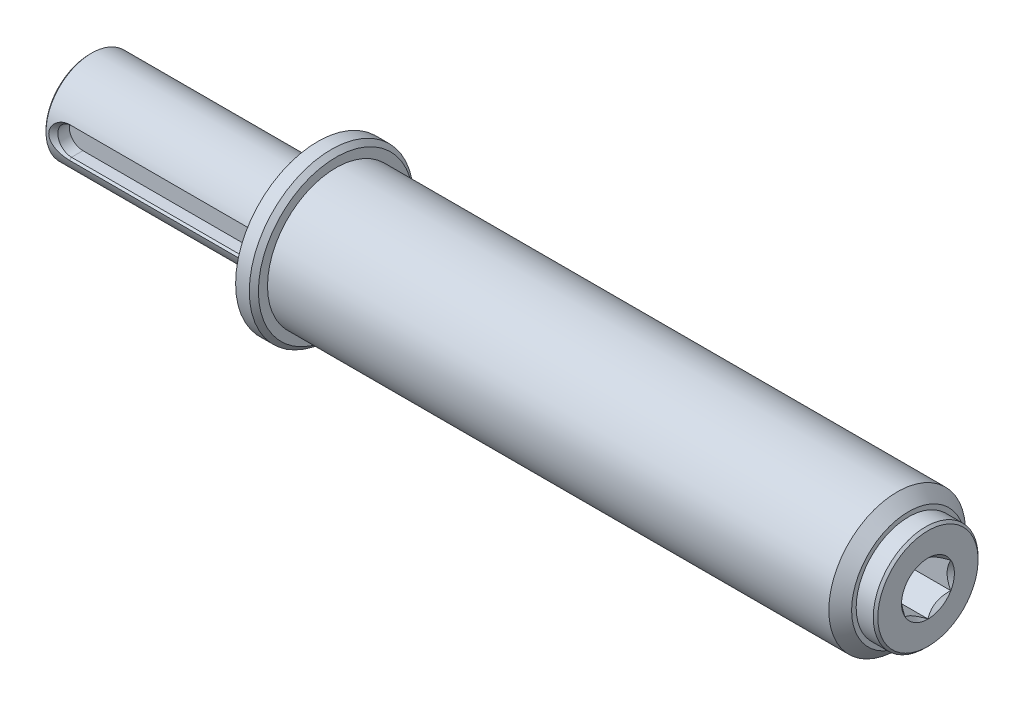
ISO-10303-21;
HEADER;
FILE_DESCRIPTION(('STEP AP214'),'2;1');
FILE_NAME('part.step','',(''),(''),'','','');
FILE_SCHEMA(('AUTOMOTIVE_DESIGN { 1 0 10303 214 1 1 1 1 }'));
ENDSEC;
DATA;
#1=APPLICATION_CONTEXT('core data for automotive mechanical design processes');
#2=APPLICATION_PROTOCOL_DEFINITION('international standard','automotive_design',2000,#1);
#3=PRODUCT_CONTEXT('',#1,'mechanical');
#4=PRODUCT('Part','Part','',(#3));
#5=PRODUCT_RELATED_PRODUCT_CATEGORY('part','',(#4));
#6=PRODUCT_DEFINITION_FORMATION('','',#4);
#7=PRODUCT_DEFINITION_CONTEXT('part definition',#1,'design');
#8=PRODUCT_DEFINITION('design','',#6,#7);
#9=PRODUCT_DEFINITION_SHAPE('','',#8);
#10=(LENGTH_UNIT() NAMED_UNIT(*) SI_UNIT(.MILLI.,.METRE.));
#11=(NAMED_UNIT(*) PLANE_ANGLE_UNIT() SI_UNIT($,.RADIAN.));
#12=(NAMED_UNIT(*) SI_UNIT($,.STERADIAN.) SOLID_ANGLE_UNIT());
#13=UNCERTAINTY_MEASURE_WITH_UNIT(LENGTH_MEASURE(1.E-05),#10,'distance_accuracy_value','');
#14=(GEOMETRIC_REPRESENTATION_CONTEXT(3) GLOBAL_UNCERTAINTY_ASSIGNED_CONTEXT((#13)) GLOBAL_UNIT_ASSIGNED_CONTEXT((#10,
#11,#12)) REPRESENTATION_CONTEXT('',''));
#15=CARTESIAN_POINT('',(0.,0.,0.));
#16=DIRECTION('',(0.,0.,1.));
#17=DIRECTION('',(1.,0.,0.));
#18=AXIS2_PLACEMENT_3D('',#15,#16,#17);
#19=CARTESIAN_POINT('',(123.9,5.,0.));
#20=DIRECTION('',(-1.,0.,0.));
#21=DIRECTION('',(0.,0.,1.));
#22=AXIS2_PLACEMENT_3D('',#19,#20,#21);
#23=PLANE('',#22);
#24=DIRECTION('',(0.,-0.500000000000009,-0.866025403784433));
#25=VECTOR('',#24,1.);
#26=CARTESIAN_POINT('',(123.9,-2.8867513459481,5.));
#27=LINE('',#26,#25);
#28=CARTESIAN_POINT('',(123.9,-2.8867513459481,5.));
#29=VERTEX_POINT('',#28);
#30=CARTESIAN_POINT('',(123.899999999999,-4.33012701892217,2.50000000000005));
#31=VERTEX_POINT('',#30);
#32=EDGE_CURVE('E185',#29,#31,#27,.T.);
#33=ORIENTED_EDGE('',*,*,#32,.T.);
#34=CARTESIAN_POINT('',(123.899999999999,0.,0.));
#35=DIRECTION('',(-1.,0.,0.));
#36=DIRECTION('',(0.,-1.,0.));
#37=AXIS2_PLACEMENT_3D('',#34,#35,#36);
#38=CIRCLE('',#37,5.00000000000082);
#39=CARTESIAN_POINT('',(123.899999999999,0.,5.00000000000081));
#40=VERTEX_POINT('',#39);
#41=EDGE_CURVE('E44',#31,#40,#38,.T.);
#42=ORIENTED_EDGE('',*,*,#41,.T.);
#43=DIRECTION('',(0.,-1.,0.));
#44=VECTOR('',#43,1.);
#45=CARTESIAN_POINT('',(123.9,2.8867513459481,5.));
#46=LINE('',#45,#44);
#47=EDGE_CURVE('E180',#40,#29,#46,.T.);
#48=ORIENTED_EDGE('',*,*,#47,.T.);
#49=EDGE_LOOP('',(#33,#42,#48));
#50=FACE_BOUND('',#49,.T.);
#51=ADVANCED_FACE('F33',(#50),#23,.F.);
#52=CARTESIAN_POINT('',(123.9,2.8867513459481,5.));
#53=VERTEX_POINT('',#52);
#54=EDGE_CURVE('E181',#53,#40,#46,.T.);
#55=ORIENTED_EDGE('',*,*,#54,.T.);
#56=CARTESIAN_POINT('',(123.899999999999,4.33012701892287,2.50000000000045));
#57=VERTEX_POINT('',#56);
#58=EDGE_CURVE('E11',#40,#57,#38,.T.);
#59=ORIENTED_EDGE('',*,*,#58,.T.);
#60=DIRECTION('',(0.,-0.500000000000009,0.866025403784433));
#61=VECTOR('',#60,1.);
#62=CARTESIAN_POINT('',(123.9,5.7735026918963,0.));
#63=LINE('',#62,#61);
#64=EDGE_CURVE('E176',#57,#53,#63,.T.);
#65=ORIENTED_EDGE('',*,*,#64,.T.);
#66=EDGE_LOOP('',(#55,#59,#65));
#67=FACE_BOUND('',#66,.T.);
#68=ADVANCED_FACE('F421',(#67),#23,.F.);
#69=CARTESIAN_POINT('',(123.9,5.7735026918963,0.));
#70=VERTEX_POINT('',#69);
#71=EDGE_CURVE('E177',#70,#57,#63,.T.);
#72=ORIENTED_EDGE('',*,*,#71,.T.);
#73=CARTESIAN_POINT('',(123.899999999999,4.33012701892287,-2.50000000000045));
#74=VERTEX_POINT('',#73);
#75=EDGE_CURVE('E42',#57,#74,#38,.T.);
#76=ORIENTED_EDGE('',*,*,#75,.T.);
#77=DIRECTION('',(0.,0.500000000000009,0.866025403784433));
#78=VECTOR('',#77,1.);
#79=CARTESIAN_POINT('',(123.9,2.8867513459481,-5.));
#80=LINE('',#79,#78);
#81=EDGE_CURVE('E196',#74,#70,#80,.T.);
#82=ORIENTED_EDGE('',*,*,#81,.T.);
#83=EDGE_LOOP('',(#72,#76,#82));
#84=FACE_BOUND('',#83,.T.);
#85=ADVANCED_FACE('F393',(#84),#23,.F.);
#86=CARTESIAN_POINT('',(123.9,2.8867513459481,-5.));
#87=VERTEX_POINT('',#86);
#88=EDGE_CURVE('E197',#87,#74,#80,.T.);
#89=ORIENTED_EDGE('',*,*,#88,.T.);
#90=CARTESIAN_POINT('',(123.899999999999,0.,-5.00000000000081));
#91=VERTEX_POINT('',#90);
#92=EDGE_CURVE('E384',#74,#91,#38,.T.);
#93=ORIENTED_EDGE('',*,*,#92,.T.);
#94=DIRECTION('',(0.,1.,0.));
#95=VECTOR('',#94,1.);
#96=CARTESIAN_POINT('',(123.9,-2.8867513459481,-5.));
#97=LINE('',#96,#95);
#98=EDGE_CURVE('E192',#91,#87,#97,.T.);
#99=ORIENTED_EDGE('',*,*,#98,.T.);
#100=EDGE_LOOP('',(#89,#93,#99));
#101=FACE_BOUND('',#100,.T.);
#102=ADVANCED_FACE('F400',(#101),#23,.F.);
#103=CARTESIAN_POINT('',(123.9,-2.8867513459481,-5.));
#104=VERTEX_POINT('',#103);
#105=EDGE_CURVE('E193',#104,#91,#97,.T.);
#106=ORIENTED_EDGE('',*,*,#105,.T.);
#107=CARTESIAN_POINT('',(123.899999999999,-4.33012701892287,-2.50000000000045));
#108=VERTEX_POINT('',#107);
#109=EDGE_CURVE('E380',#91,#108,#38,.T.);
#110=ORIENTED_EDGE('',*,*,#109,.T.);
#111=DIRECTION('',(0.,0.500000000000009,-0.866025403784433));
#112=VECTOR('',#111,1.);
#113=CARTESIAN_POINT('',(123.9,-5.7735026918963,0.));
#114=LINE('',#113,#112);
#115=EDGE_CURVE('E188',#108,#104,#114,.T.);
#116=ORIENTED_EDGE('',*,*,#115,.T.);
#117=EDGE_LOOP('',(#106,#110,#116));
#118=FACE_BOUND('',#117,.T.);
#119=ADVANCED_FACE('F406',(#118),#23,.F.);
#120=CARTESIAN_POINT('',(-50.,0.,0.));
#121=DIRECTION('',(1.,0.,0.));
#122=DIRECTION('',(0.,0.,-1.));
#123=AXIS2_PLACEMENT_3D('',#120,#121,#122);
#124=PLANE('',#123);
#125=CARTESIAN_POINT('',(-50.,0.,0.));
#126=DIRECTION('',(-1.,0.,0.));
#127=DIRECTION('',(0.,0.,1.));
#128=AXIS2_PLACEMENT_3D('',#125,#126,#127);
#129=CIRCLE('',#128,9.6);
#130=CARTESIAN_POINT('',(-50.,0.,9.6));
#131=VERTEX_POINT('',#130);
#132=EDGE_CURVE('E370',#131,#131,#129,.T.);
#133=ORIENTED_EDGE('',*,*,#132,.T.);
#134=EDGE_LOOP('',(#133));
#135=FACE_BOUND('',#134,.T.);
#136=CARTESIAN_POINT('',(-50.,0.,0.));
#137=DIRECTION('',(-1.,0.,0.));
#138=DIRECTION('',(0.,0.,1.));
#139=AXIS2_PLACEMENT_3D('',#136,#137,#138);
#140=CIRCLE('',#139,4.8);
#141=CARTESIAN_POINT('',(-50.,0.,4.8));
#142=VERTEX_POINT('',#141);
#143=EDGE_CURVE('E173',#142,#142,#140,.T.);
#144=ORIENTED_EDGE('',*,*,#143,.F.);
#145=EDGE_LOOP('',(#144));
#146=FACE_BOUND('',#145,.T.);
#147=ADVANCED_FACE('F35',(#135,#146),#124,.F.);
#148=CARTESIAN_POINT('',(123.9,0.,0.));
#149=DIRECTION('',(-1.,0.,0.));
#150=DIRECTION('',(0.,0.,1.));
#151=AXIS2_PLACEMENT_3D('',#148,#149,#150);
#152=CYLINDRICAL_SURFACE('',#151,10.);
#153=CARTESIAN_POINT('',(-49.6,0.,0.));
#154=DIRECTION('',(-1.,0.,0.));
#155=DIRECTION('',(0.,0.,1.));
#156=AXIS2_PLACEMENT_3D('',#153,#154,#155);
#157=CIRCLE('',#156,10.);
#158=CARTESIAN_POINT('',(-49.6,0.,10.));
#159=VERTEX_POINT('',#158);
#160=EDGE_CURVE('E367',#159,#159,#157,.T.);
#161=ORIENTED_EDGE('',*,*,#160,.F.);
#162=EDGE_LOOP('',(#161));
#163=FACE_BOUND('',#162,.T.);
#164=CARTESIAN_POINT('',(0.,0.,0.));
#165=DIRECTION('',(-1.,0.,0.));
#166=DIRECTION('',(0.,0.,1.));
#167=AXIS2_PLACEMENT_3D('',#164,#165,#166);
#168=CIRCLE('',#167,10.);
#169=CARTESIAN_POINT('',(0.,0.,10.));
#170=VERTEX_POINT('',#169);
#171=EDGE_CURVE('E364',#170,#170,#168,.T.);
#172=ORIENTED_EDGE('',*,*,#171,.T.);
#173=EDGE_LOOP('',(#172));
#174=FACE_BOUND('',#173,.T.);
#175=CARTESIAN_POINT('',(-47.717157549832,-2.48948158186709,9.68516824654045));
#176=CARTESIAN_POINT('',(-47.5363287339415,-2.63244008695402,9.64842427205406));
#177=CARTESIAN_POINT('',(-47.342390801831,-2.75952410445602,9.61240031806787));
#178=CARTESIAN_POINT('',(-46.9351005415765,-2.98055133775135,9.54618873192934));
#179=CARTESIAN_POINT('',(-46.7216897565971,-3.07439034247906,9.51601958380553));
#180=CARTESIAN_POINT('',(-46.2804854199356,-3.22810088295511,9.46498683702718));
#181=CARTESIAN_POINT('',(-46.0526163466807,-3.28777436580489,9.44417764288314));
#182=CARTESIAN_POINT('',(-45.5898860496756,-3.37146086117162,9.41462895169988));
#183=CARTESIAN_POINT('',(-45.355030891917,-3.39550393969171,9.40587927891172));
#184=CARTESIAN_POINT('',(-44.8748222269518,-3.4078988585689,9.40139890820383));
#185=CARTESIAN_POINT('',(-44.6294242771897,-3.39478583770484,9.40620251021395));
#186=CARTESIAN_POINT('',(-44.1443693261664,-3.32990001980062,9.42936491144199));
#187=CARTESIAN_POINT('',(-43.9047144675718,-3.27811301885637,9.44772869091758));
#188=CARTESIAN_POINT('',(-43.4378527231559,-3.13659796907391,9.49564700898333));
#189=CARTESIAN_POINT('',(-43.2106548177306,-3.04684294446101,9.52520950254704));
#190=CARTESIAN_POINT('',(-42.775539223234,-2.83030347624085,9.59177639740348));
#191=CARTESIAN_POINT('',(-42.5676333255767,-2.7034965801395,9.62878530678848));
#192=CARTESIAN_POINT('',(-42.183353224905,-2.41751127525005,9.70448370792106));
#193=CARTESIAN_POINT('',(-42.0063524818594,-2.25916426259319,9.74311321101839));
#194=CARTESIAN_POINT('',(-41.6867807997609,-1.91039447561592,9.81742822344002));
#195=CARTESIAN_POINT('',(-41.5441277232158,-1.72005010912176,9.85312061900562));
#196=CARTESIAN_POINT('',(-41.3394824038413,-1.37351887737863,9.90627400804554));
#197=CARTESIAN_POINT('',(-41.2661386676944,-1.22434019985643,9.9259870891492));
#198=CARTESIAN_POINT('',(-41.1445352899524,-0.91542564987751,9.95921852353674));
#199=CARTESIAN_POINT('',(-41.096253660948,-0.755699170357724,9.97274230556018));
#200=CARTESIAN_POINT('',(-41.0274855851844,-0.429102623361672,9.99213297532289));
#201=CARTESIAN_POINT('',(-41.0071240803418,-0.262203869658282,9.99796544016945));
#202=CARTESIAN_POINT('',(-40.9960199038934,0.072666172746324,10.001136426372));
#203=CARTESIAN_POINT('',(-41.0052737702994,0.240637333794,9.99847594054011));
#204=CARTESIAN_POINT('',(-41.0509980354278,0.560045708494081,9.98549363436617));
#205=CARTESIAN_POINT('',(-41.0854574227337,0.711801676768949,9.97573819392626));
#206=CARTESIAN_POINT('',(-41.1773373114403,1.0076135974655,9.95021501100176));
#207=CARTESIAN_POINT('',(-41.2347616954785,1.15166824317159,9.93444625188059));
#208=CARTESIAN_POINT('',(-41.3734100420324,1.43648203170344,9.89738508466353));
#209=CARTESIAN_POINT('',(-41.4557198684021,1.57667662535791,9.875847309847));
#210=CARTESIAN_POINT('',(-41.6394130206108,1.84331459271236,9.82957478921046));
#211=CARTESIAN_POINT('',(-41.740804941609,1.9697517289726,9.80483860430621));
#212=CARTESIAN_POINT('',(-41.9764890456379,2.22609745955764,9.75008939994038));
#213=CARTESIAN_POINT('',(-42.1134448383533,2.3535062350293,9.71985277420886));
#214=CARTESIAN_POINT('',(-42.404396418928,2.5873223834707,9.66024558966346));
#215=CARTESIAN_POINT('',(-42.5584032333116,2.69371604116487,9.63087560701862));
#216=CARTESIAN_POINT('',(-42.9068184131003,2.90088146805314,9.57070683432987));
#217=CARTESIAN_POINT('',(-43.1036726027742,2.99772441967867,9.54049316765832));
#218=CARTESIAN_POINT('',(-43.5105451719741,3.16107972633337,9.48762107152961));
#219=CARTESIAN_POINT('',(-43.7205689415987,3.22757956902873,9.46496575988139));
#220=CARTESIAN_POINT('',(-44.1689056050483,3.33429628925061,9.42793827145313));
#221=CARTESIAN_POINT('',(-44.4080286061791,3.37147842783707,9.41453730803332));
#222=CARTESIAN_POINT('',(-44.8895024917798,3.40810353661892,9.40134078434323));
#223=CARTESIAN_POINT('',(-45.1318534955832,3.40754510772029,9.40154572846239));
#224=CARTESIAN_POINT('',(-45.6166499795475,3.36842039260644,9.41563502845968));
#225=CARTESIAN_POINT('',(-45.859045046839,3.32929858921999,9.42971931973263));
#226=CARTESIAN_POINT('',(-46.3335575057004,3.21280754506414,9.47003854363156));
#227=CARTESIAN_POINT('',(-46.5656693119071,3.13541778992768,9.4962799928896));
#228=CARTESIAN_POINT('',(-47.0126218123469,2.94340918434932,9.55753491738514));
#229=CARTESIAN_POINT('',(-47.2274698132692,2.82880618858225,9.59254465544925));
#230=CARTESIAN_POINT('',(-47.6327374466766,2.56348382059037,9.66682212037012));
#231=CARTESIAN_POINT('',(-47.8231826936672,2.41280280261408,9.70608530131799));
#232=CARTESIAN_POINT('',(-48.1324906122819,2.114498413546,9.77480365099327));
#233=CARTESIAN_POINT('',(-48.2578519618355,1.97365541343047,9.80449720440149));
#234=CARTESIAN_POINT('',(-48.4840199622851,1.67273061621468,9.86029033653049));
#235=CARTESIAN_POINT('',(-48.5848408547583,1.51266005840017,9.8863919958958));
#236=CARTESIAN_POINT('',(-48.7573942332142,1.17478775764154,9.93222614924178));
#237=CARTESIAN_POINT('',(-48.8288770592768,0.996849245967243,9.95190369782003));
#238=CARTESIAN_POINT('',(-48.9363181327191,0.629798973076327,9.98183694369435));
#239=CARTESIAN_POINT('',(-48.9723170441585,0.440700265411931,9.99210342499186));
#240=CARTESIAN_POINT('',(-49.0034150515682,0.086248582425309,10.000971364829));
#241=CARTESIAN_POINT('',(-49.0036261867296,-0.0786336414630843,10.001030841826));
#242=CARTESIAN_POINT('',(-48.9758179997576,-0.40575931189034,9.99310238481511));
#243=CARTESIAN_POINT('',(-48.9478061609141,-0.568003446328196,9.98511658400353));
#244=CARTESIAN_POINT('',(-48.8675168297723,-0.876804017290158,9.96262993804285));
#245=CARTESIAN_POINT('',(-48.8165657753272,-1.02373796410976,9.9484864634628));
#246=CARTESIAN_POINT('',(-48.6934540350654,-1.30784040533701,9.91514216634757));
#247=CARTESIAN_POINT('',(-48.6212796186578,-1.44500250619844,9.89593807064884));
#248=CARTESIAN_POINT('',(-48.450681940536,-1.72018444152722,9.85201789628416));
#249=CARTESIAN_POINT('',(-48.3503816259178,-1.85697568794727,9.82694639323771));
#250=CARTESIAN_POINT('',(-48.1315461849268,-2.11432961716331,9.77480695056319));
#251=CARTESIAN_POINT('',(-48.013032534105,-2.23491110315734,9.74774138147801));
#252=CARTESIAN_POINT('',(-47.8318688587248,-2.39609165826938,9.70882578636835));
#253=CARTESIAN_POINT('',(-47.7751882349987,-2.44360404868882,9.69695994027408));
#254=CARTESIAN_POINT('',(-47.717157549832,-2.48948158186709,9.68516824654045));
#255=B_SPLINE_CURVE_WITH_KNOTS('',3,(#175,#176,#177,#178,#179,#180,#181,#182,#183,#184,#185,
#186,#187,#188,#189,#190,#191,#192,#193,#194,#195,#196,#197,#198,#199,#200,#201,#202,#203,#204,
#205,#206,#207,#208,#209,#210,#211,#212,#213,#214,#215,#216,#217,#218,#219,#220,#221,#222,#223,
#224,#225,#226,#227,#228,#229,#230,#231,#232,#233,#234,#235,#236,#237,#238,#239,#240,#241,#242,
#243,#244,#245,#246,#247,#248,#249,#250,#251,#252,#253,#254),.UNSPECIFIED.,.T.,.F.,(4,2,2,2,2,2,
2,2,2,2,2,2,2,2,2,2,2,2,2,2,2,2,2,2,2,2,2,2,2,2,2,2,2,2,2,2,2,2,2,4),(0.,0.700061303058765,
1.40229802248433,2.10856533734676,2.81423634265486,3.54811060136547,4.28225452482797,
5.01692092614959,5.75203344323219,6.4698586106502,7.1859497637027,7.68610441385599,
8.18581952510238,8.68776363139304,9.18964906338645,9.65533811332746,10.1211059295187,
10.6111867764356,11.1014889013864,11.667791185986,12.2344618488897,12.8960792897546,
13.55796931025,14.2816763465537,15.0054102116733,15.7397243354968,16.4744325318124,
17.2088281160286,17.9424464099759,18.5128226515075,19.0828670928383,19.657666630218,
20.2318066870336,20.7238539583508,21.2157707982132,21.6823093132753,22.149150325,
22.6616581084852,23.1735661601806,23.3982263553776),.UNSPECIFIED.);
#256=CARTESIAN_POINT('',(-45.,3.40312423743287,9.40312423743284));
#257=VERTEX_POINT('',#256);
#258=CARTESIAN_POINT('',(-45.,-3.40312423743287,9.40312423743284));
#259=VERTEX_POINT('',#258);
#260=EDGE_CURVE('E268',#257,#259,#255,.T.);
#261=ORIENTED_EDGE('',*,*,#260,.F.);
#262=DIRECTION('',(-1.,0.,0.));
#263=VECTOR('',#262,1.);
#264=CARTESIAN_POINT('',(123.9,3.40312423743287,9.40312423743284));
#265=LINE('',#264,#263);
#266=CARTESIAN_POINT('',(-5.9,3.40312423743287,9.40312423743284));
#267=VERTEX_POINT('',#266);
#268=EDGE_CURVE('E37',#257,#267,#265,.F.);
#269=ORIENTED_EDGE('',*,*,#268,.T.);
#270=CARTESIAN_POINT('',(-8.61715754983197,-2.48948158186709,9.68516824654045));
#271=CARTESIAN_POINT('',(-8.43632873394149,-2.63244008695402,9.64842427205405));
#272=CARTESIAN_POINT('',(-8.24239080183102,-2.75952410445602,9.61240031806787));
#273=CARTESIAN_POINT('',(-7.83510054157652,-2.98055133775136,9.54618873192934));
#274=CARTESIAN_POINT('',(-7.62168975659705,-3.07439034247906,9.51601958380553));
#275=CARTESIAN_POINT('',(-7.18048541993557,-3.22810088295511,9.46498683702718));
#276=CARTESIAN_POINT('',(-6.95261634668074,-3.28777436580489,9.44417764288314));
#277=CARTESIAN_POINT('',(-6.48988604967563,-3.37146086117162,9.41462895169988));
#278=CARTESIAN_POINT('',(-6.25503089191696,-3.39550393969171,9.40587927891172));
#279=CARTESIAN_POINT('',(-5.77482222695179,-3.4078988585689,9.40139890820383));
#280=CARTESIAN_POINT('',(-5.52942427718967,-3.39478583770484,9.40620251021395));
#281=CARTESIAN_POINT('',(-5.04436932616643,-3.32990001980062,9.42936491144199));
#282=CARTESIAN_POINT('',(-4.80471446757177,-3.27811301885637,9.44772869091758));
#283=CARTESIAN_POINT('',(-4.33785272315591,-3.13659796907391,9.49564700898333));
#284=CARTESIAN_POINT('',(-4.11065481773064,-3.04684294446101,9.52520950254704));
#285=CARTESIAN_POINT('',(-3.67553922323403,-2.83030347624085,9.59177639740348));
#286=CARTESIAN_POINT('',(-3.46763332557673,-2.7034965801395,9.62878530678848));
#287=CARTESIAN_POINT('',(-3.08335322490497,-2.41751127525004,9.70448370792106));
#288=CARTESIAN_POINT('',(-2.90635248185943,-2.25916426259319,9.74311321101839));
#289=CARTESIAN_POINT('',(-2.58678079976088,-1.91039447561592,9.81742822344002));
#290=CARTESIAN_POINT('',(-2.44412772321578,-1.72005010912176,9.85312061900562));
#291=CARTESIAN_POINT('',(-2.23948240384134,-1.37351887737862,9.90627400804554));
#292=CARTESIAN_POINT('',(-2.16613866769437,-1.22434019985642,9.9259870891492));
#293=CARTESIAN_POINT('',(-2.0445352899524,-0.915425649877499,9.95921852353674));
#294=CARTESIAN_POINT('',(-1.99625366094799,-0.755699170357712,9.97274230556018));
#295=CARTESIAN_POINT('',(-1.92748558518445,-0.429102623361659,9.99213297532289));
#296=CARTESIAN_POINT('',(-1.90712408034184,-0.26220386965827,9.99796544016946));
#297=CARTESIAN_POINT('',(-1.89601990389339,0.0726661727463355,10.001136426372));
#298=CARTESIAN_POINT('',(-1.90527377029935,0.240637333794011,9.99847594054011));
#299=CARTESIAN_POINT('',(-1.95099803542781,0.560045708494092,9.98549363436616));
#300=CARTESIAN_POINT('',(-1.98545742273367,0.71180167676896,9.97573819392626));
#301=CARTESIAN_POINT('',(-2.07733731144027,1.00761359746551,9.95021501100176));
#302=CARTESIAN_POINT('',(-2.13476169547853,1.1516682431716,9.93444625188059));
#303=CARTESIAN_POINT('',(-2.27341004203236,1.43648203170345,9.89738508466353));
#304=CARTESIAN_POINT('',(-2.3557198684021,1.57667662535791,9.875847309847));
#305=CARTESIAN_POINT('',(-2.53941302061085,1.84331459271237,9.82957478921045));
#306=CARTESIAN_POINT('',(-2.64080494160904,1.96975172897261,9.80483860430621));
#307=CARTESIAN_POINT('',(-2.8764890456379,2.22609745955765,9.75008939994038));
#308=CARTESIAN_POINT('',(-3.01344483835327,2.3535062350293,9.71985277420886));
#309=CARTESIAN_POINT('',(-3.30439641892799,2.58732238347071,9.66024558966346));
#310=CARTESIAN_POINT('',(-3.45840323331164,2.69371604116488,9.63087560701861));
#311=CARTESIAN_POINT('',(-3.80681841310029,2.90088146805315,9.57070683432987));
#312=CARTESIAN_POINT('',(-4.00367260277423,2.99772441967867,9.54049316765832));
#313=CARTESIAN_POINT('',(-4.41054517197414,3.16107972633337,9.48762107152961));
#314=CARTESIAN_POINT('',(-4.62056894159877,3.22757956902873,9.46496575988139));
#315=CARTESIAN_POINT('',(-5.06890560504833,3.33429628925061,9.42793827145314));
#316=CARTESIAN_POINT('',(-5.3080286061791,3.37147842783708,9.41453730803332));
#317=CARTESIAN_POINT('',(-5.7895024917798,3.40810353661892,9.40134078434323));
#318=CARTESIAN_POINT('',(-6.0318534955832,3.40754510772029,9.40154572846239));
#319=CARTESIAN_POINT('',(-6.51664997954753,3.36842039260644,9.41563502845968));
#320=CARTESIAN_POINT('',(-6.75904504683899,3.32929858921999,9.42971931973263));
#321=CARTESIAN_POINT('',(-7.2335575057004,3.21280754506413,9.47003854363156));
#322=CARTESIAN_POINT('',(-7.46566931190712,3.13541778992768,9.4962799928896));
#323=CARTESIAN_POINT('',(-7.9126218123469,2.94340918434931,9.55753491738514));
#324=CARTESIAN_POINT('',(-8.12746981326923,2.82880618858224,9.59254465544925));
#325=CARTESIAN_POINT('',(-8.53273744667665,2.56348382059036,9.66682212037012));
#326=CARTESIAN_POINT('',(-8.72318269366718,2.41280280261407,9.70608530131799));
#327=CARTESIAN_POINT('',(-9.03249061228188,2.11449841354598,9.77480365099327));
#328=CARTESIAN_POINT('',(-9.15785196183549,1.97365541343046,9.8044972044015));
#329=CARTESIAN_POINT('',(-9.38401996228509,1.67273061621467,9.86029033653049));
#330=CARTESIAN_POINT('',(-9.48484085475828,1.51266005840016,9.8863919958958));
#331=CARTESIAN_POINT('',(-9.65739423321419,1.17478775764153,9.93222614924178));
#332=CARTESIAN_POINT('',(-9.72887705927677,0.996849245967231,9.95190369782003));
#333=CARTESIAN_POINT('',(-9.83631813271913,0.629798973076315,9.98183694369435));
#334=CARTESIAN_POINT('',(-9.87231704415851,0.440700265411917,9.99210342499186));
#335=CARTESIAN_POINT('',(-9.90341505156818,0.0862485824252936,10.000971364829));
#336=CARTESIAN_POINT('',(-9.90362618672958,-0.0786336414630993,10.001030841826));
#337=CARTESIAN_POINT('',(-9.87581799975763,-0.405759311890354,9.99310238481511));
#338=CARTESIAN_POINT('',(-9.84780616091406,-0.568003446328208,9.98511658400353));
#339=CARTESIAN_POINT('',(-9.76751682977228,-0.87680401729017,9.96262993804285));
#340=CARTESIAN_POINT('',(-9.71656577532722,-1.02373796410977,9.9484864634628));
#341=CARTESIAN_POINT('',(-9.59345403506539,-1.30784040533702,9.91514216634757));
#342=CARTESIAN_POINT('',(-9.5212796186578,-1.44500250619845,9.89593807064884));
#343=CARTESIAN_POINT('',(-9.35068194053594,-1.72018444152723,9.85201789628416));
#344=CARTESIAN_POINT('',(-9.25038162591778,-1.85697568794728,9.8269463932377));
#345=CARTESIAN_POINT('',(-9.03154618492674,-2.11432961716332,9.77480695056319));
#346=CARTESIAN_POINT('',(-8.91303253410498,-2.23491110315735,9.74774138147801));
#347=CARTESIAN_POINT('',(-8.7318688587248,-2.39609165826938,9.70882578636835));
#348=CARTESIAN_POINT('',(-8.67518823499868,-2.44360404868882,9.69695994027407));
#349=CARTESIAN_POINT('',(-8.61715754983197,-2.48948158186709,9.68516824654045));
#350=B_SPLINE_CURVE_WITH_KNOTS('',3,(#270,#271,#272,#273,#274,#275,#276,#277,#278,#279,#280,
#281,#282,#283,#284,#285,#286,#287,#288,#289,#290,#291,#292,#293,#294,#295,#296,#297,#298,#299,
#300,#301,#302,#303,#304,#305,#306,#307,#308,#309,#310,#311,#312,#313,#314,#315,#316,#317,#318,
#319,#320,#321,#322,#323,#324,#325,#326,#327,#328,#329,#330,#331,#332,#333,#334,#335,#336,#337,
#338,#339,#340,#341,#342,#343,#344,#345,#346,#347,#348,#349),.UNSPECIFIED.,.T.,.F.,(4,2,2,2,2,2,
2,2,2,2,2,2,2,2,2,2,2,2,2,2,2,2,2,2,2,2,2,2,2,2,2,2,2,2,2,2,2,2,2,4),(0.,0.700061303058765,
1.40229802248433,2.10856533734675,2.81423634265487,3.54811060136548,4.28225452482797,
5.01692092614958,5.75203344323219,6.46985861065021,7.18594976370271,7.68610441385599,
8.18581952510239,8.68776363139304,9.18964906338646,9.65533811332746,10.1211059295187,
10.6111867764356,11.1014889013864,11.667791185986,12.2344618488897,12.8960792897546,
13.5579693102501,14.2816763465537,15.0054102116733,15.7397243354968,16.4744325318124,
17.2088281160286,17.9424464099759,18.5128226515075,19.0828670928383,19.6576666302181,
20.2318066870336,20.7238539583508,21.2157707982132,21.6823093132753,22.149150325,
22.6616581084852,23.1735661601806,23.3982263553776),.UNSPECIFIED.);
#351=CARTESIAN_POINT('',(-5.89999999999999,-3.40312423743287,9.40312423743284));
#352=VERTEX_POINT('',#351);
#353=EDGE_CURVE('E296',#352,#267,#350,.T.);
#354=ORIENTED_EDGE('',*,*,#353,.F.);
#355=DIRECTION('',(-1.,0.,0.));
#356=VECTOR('',#355,1.);
#357=CARTESIAN_POINT('',(123.9,-3.40312423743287,9.40312423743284));
#358=LINE('',#357,#356);
#359=EDGE_CURVE('E372',#352,#259,#358,.T.);
#360=ORIENTED_EDGE('',*,*,#359,.T.);
#361=EDGE_LOOP('',(#261,#269,#354,#360));
#362=FACE_BOUND('',#361,.T.);
#363=ADVANCED_FACE('F275',(#163,#174,#362),#152,.T.);
#364=CARTESIAN_POINT('',(-49.6,0.,0.));
#365=DIRECTION('',(1.,0.,0.));
#366=DIRECTION('',(0.,0.,-1.));
#367=AXIS2_PLACEMENT_3D('',#364,#365,#366);
#368=CONICAL_SURFACE('',#367,10.,0.78539816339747);
#369=ORIENTED_EDGE('',*,*,#132,.F.);
#370=EDGE_LOOP('',(#369));
#371=FACE_BOUND('',#370,.T.);
#372=ORIENTED_EDGE('',*,*,#160,.T.);
#373=EDGE_LOOP('',(#372));
#374=FACE_BOUND('',#373,.T.);
#375=ADVANCED_FACE('F604',(#371,#374),#368,.T.);
#376=CARTESIAN_POINT('',(0.,10.,0.));
#377=DIRECTION('',(1.,0.,0.));
#378=DIRECTION('',(0.,0.,-1.));
#379=AXIS2_PLACEMENT_3D('',#376,#377,#378);
#380=PLANE('',#379);
#381=ORIENTED_EDGE('',*,*,#171,.F.);
#382=EDGE_LOOP('',(#381));
#383=FACE_BOUND('',#382,.T.);
#384=CARTESIAN_POINT('',(0.,0.,0.));
#385=DIRECTION('',(-1.,0.,0.));
#386=DIRECTION('',(0.,0.,1.));
#387=AXIS2_PLACEMENT_3D('',#384,#385,#386);
#388=CIRCLE('',#387,18.);
#389=CARTESIAN_POINT('',(0.,0.,18.));
#390=VERTEX_POINT('',#389);
#391=EDGE_CURVE('E361',#390,#390,#388,.T.);
#392=ORIENTED_EDGE('',*,*,#391,.T.);
#393=EDGE_LOOP('',(#392));
#394=FACE_BOUND('',#393,.T.);
#395=ADVANCED_FACE('F701',(#383,#394),#380,.F.);
#396=CARTESIAN_POINT('',(123.9,0.,0.));
#397=DIRECTION('',(-1.,0.,0.));
#398=DIRECTION('',(0.,0.,1.));
#399=AXIS2_PLACEMENT_3D('',#396,#397,#398);
#400=CYLINDRICAL_SURFACE('',#399,18.);
#401=ORIENTED_EDGE('',*,*,#391,.F.);
#402=EDGE_LOOP('',(#401));
#403=FACE_BOUND('',#402,.T.);
#404=CARTESIAN_POINT('',(3.,0.,0.));
#405=DIRECTION('',(-1.,0.,0.));
#406=DIRECTION('',(0.,0.,1.));
#407=AXIS2_PLACEMENT_3D('',#404,#405,#406);
#408=CIRCLE('',#407,18.);
#409=CARTESIAN_POINT('',(3.,0.,18.));
#410=VERTEX_POINT('',#409);
#411=EDGE_CURVE('E358',#410,#410,#408,.T.);
#412=ORIENTED_EDGE('',*,*,#411,.T.);
#413=EDGE_LOOP('',(#412));
#414=FACE_BOUND('',#413,.T.);
#415=ADVANCED_FACE('F691',(#403,#414),#400,.T.);
#416=CARTESIAN_POINT('',(4.,0.,0.));
#417=DIRECTION('',(-1.,0.,0.));
#418=DIRECTION('',(0.,0.,1.));
#419=AXIS2_PLACEMENT_3D('',#416,#417,#418);
#420=CONICAL_SURFACE('',#419,17.,0.785398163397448);
#421=ORIENTED_EDGE('',*,*,#411,.F.);
#422=EDGE_LOOP('',(#421));
#423=FACE_BOUND('',#422,.T.);
#424=CARTESIAN_POINT('',(4.,0.,0.));
#425=DIRECTION('',(-1.,0.,0.));
#426=DIRECTION('',(0.,0.,1.));
#427=AXIS2_PLACEMENT_3D('',#424,#425,#426);
#428=CIRCLE('',#427,17.);
#429=CARTESIAN_POINT('',(4.,0.,17.));
#430=VERTEX_POINT('',#429);
#431=EDGE_CURVE('E355',#430,#430,#428,.T.);
#432=ORIENTED_EDGE('',*,*,#431,.T.);
#433=EDGE_LOOP('',(#432));
#434=FACE_BOUND('',#433,.T.);
#435=ADVANCED_FACE('F681',(#423,#434),#420,.T.);
#436=CARTESIAN_POINT('',(4.,17.,0.));
#437=DIRECTION('',(-1.,0.,0.));
#438=DIRECTION('',(0.,0.,1.));
#439=AXIS2_PLACEMENT_3D('',#436,#437,#438);
#440=PLANE('',#439);
#441=ORIENTED_EDGE('',*,*,#431,.F.);
#442=EDGE_LOOP('',(#441));
#443=FACE_BOUND('',#442,.T.);
#444=CARTESIAN_POINT('',(4.,0.,0.));
#445=DIRECTION('',(-1.,0.,0.));
#446=DIRECTION('',(0.,0.,1.));
#447=AXIS2_PLACEMENT_3D('',#444,#445,#446);
#448=CIRCLE('',#447,15.);
#449=CARTESIAN_POINT('',(4.,0.,15.));
#450=VERTEX_POINT('',#449);
#451=EDGE_CURVE('E352',#450,#450,#448,.T.);
#452=ORIENTED_EDGE('',*,*,#451,.T.);
#453=EDGE_LOOP('',(#452));
#454=FACE_BOUND('',#453,.T.);
#455=ADVANCED_FACE('F671',(#443,#454),#440,.F.);
#456=CARTESIAN_POINT('',(123.9,0.,0.));
#457=DIRECTION('',(-1.,0.,0.));
#458=DIRECTION('',(0.,0.,1.));
#459=AXIS2_PLACEMENT_3D('',#456,#457,#458);
#460=CYLINDRICAL_SURFACE('',#459,15.);
#461=ORIENTED_EDGE('',*,*,#451,.F.);
#462=EDGE_LOOP('',(#461));
#463=FACE_BOUND('',#462,.T.);
#464=CARTESIAN_POINT('',(127.15,0.,0.));
#465=DIRECTION('',(-1.,0.,0.));
#466=DIRECTION('',(0.,0.,1.));
#467=AXIS2_PLACEMENT_3D('',#464,#465,#466);
#468=CIRCLE('',#467,15.);
#469=CARTESIAN_POINT('',(127.15,0.,15.));
#470=VERTEX_POINT('',#469);
#471=EDGE_CURVE('E349',#470,#470,#468,.T.);
#472=ORIENTED_EDGE('',*,*,#471,.T.);
#473=EDGE_LOOP('',(#472));
#474=FACE_BOUND('',#473,.T.);
#475=ADVANCED_FACE('F661',(#463,#474),#460,.T.);
#476=CARTESIAN_POINT('',(129.65,0.,0.));
#477=DIRECTION('',(-1.,0.,0.));
#478=DIRECTION('',(0.,0.,1.));
#479=AXIS2_PLACEMENT_3D('',#476,#477,#478);
#480=CONICAL_SURFACE('',#479,12.5,0.785398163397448);
#481=ORIENTED_EDGE('',*,*,#471,.F.);
#482=EDGE_LOOP('',(#481));
#483=FACE_BOUND('',#482,.T.);
#484=CARTESIAN_POINT('',(129.65,0.,0.));
#485=DIRECTION('',(-1.,0.,0.));
#486=DIRECTION('',(0.,0.,1.));
#487=AXIS2_PLACEMENT_3D('',#484,#485,#486);
#488=CIRCLE('',#487,12.5);
#489=CARTESIAN_POINT('',(129.65,0.,12.5));
#490=VERTEX_POINT('',#489);
#491=EDGE_CURVE('E346',#490,#490,#488,.T.);
#492=ORIENTED_EDGE('',*,*,#491,.T.);
#493=EDGE_LOOP('',(#492));
#494=FACE_BOUND('',#493,.T.);
#495=ADVANCED_FACE('F651',(#483,#494),#480,.T.);
#496=CARTESIAN_POINT('',(129.65,12.5,0.));
#497=DIRECTION('',(-1.,0.,0.));
#498=DIRECTION('',(0.,0.,1.));
#499=AXIS2_PLACEMENT_3D('',#496,#497,#498);
#500=PLANE('',#499);
#501=ORIENTED_EDGE('',*,*,#491,.F.);
#502=EDGE_LOOP('',(#501));
#503=FACE_BOUND('',#502,.T.);
#504=CARTESIAN_POINT('',(129.65,0.,0.));
#505=DIRECTION('',(-1.,0.,0.));
#506=DIRECTION('',(0.,0.,1.));
#507=AXIS2_PLACEMENT_3D('',#504,#505,#506);
#508=CIRCLE('',#507,11.5);
#509=CARTESIAN_POINT('',(129.65,0.,11.5));
#510=VERTEX_POINT('',#509);
#511=EDGE_CURVE('E343',#510,#510,#508,.T.);
#512=ORIENTED_EDGE('',*,*,#511,.T.);
#513=EDGE_LOOP('',(#512));
#514=FACE_BOUND('',#513,.T.);
#515=ADVANCED_FACE('F641',(#503,#514),#500,.F.);
#516=CARTESIAN_POINT('',(123.9,0.,0.));
#517=DIRECTION('',(-1.,0.,0.));
#518=DIRECTION('',(0.,0.,1.));
#519=AXIS2_PLACEMENT_3D('',#516,#517,#518);
#520=CYLINDRICAL_SURFACE('',#519,11.5);
#521=ORIENTED_EDGE('',*,*,#511,.F.);
#522=EDGE_LOOP('',(#521));
#523=FACE_BOUND('',#522,.T.);
#524=CARTESIAN_POINT('',(133.4,0.,0.));
#525=DIRECTION('',(-1.,0.,0.));
#526=DIRECTION('',(0.,0.,1.));
#527=AXIS2_PLACEMENT_3D('',#524,#525,#526);
#528=CIRCLE('',#527,11.5);
#529=CARTESIAN_POINT('',(133.4,0.,11.5));
#530=VERTEX_POINT('',#529);
#531=EDGE_CURVE('E340',#530,#530,#528,.T.);
#532=ORIENTED_EDGE('',*,*,#531,.T.);
#533=EDGE_LOOP('',(#532));
#534=FACE_BOUND('',#533,.T.);
#535=ADVANCED_FACE('F631',(#523,#534),#520,.T.);
#536=CARTESIAN_POINT('',(133.9,0.,0.));
#537=DIRECTION('',(-1.,0.,0.));
#538=DIRECTION('',(0.,0.,1.));
#539=AXIS2_PLACEMENT_3D('',#536,#537,#538);
#540=CONICAL_SURFACE('',#539,11.,0.785398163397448);
#541=ORIENTED_EDGE('',*,*,#531,.F.);
#542=EDGE_LOOP('',(#541));
#543=FACE_BOUND('',#542,.T.);
#544=CARTESIAN_POINT('',(133.9,0.,0.));
#545=DIRECTION('',(-1.,0.,0.));
#546=DIRECTION('',(0.,0.,1.));
#547=AXIS2_PLACEMENT_3D('',#544,#545,#546);
#548=CIRCLE('',#547,11.);
#549=CARTESIAN_POINT('',(133.9,0.,11.));
#550=VERTEX_POINT('',#549);
#551=EDGE_CURVE('E337',#550,#550,#548,.T.);
#552=ORIENTED_EDGE('',*,*,#551,.T.);
#553=EDGE_LOOP('',(#552));
#554=FACE_BOUND('',#553,.T.);
#555=ADVANCED_FACE('F437',(#543,#554),#540,.T.);
#556=CARTESIAN_POINT('',(133.9,11.,0.));
#557=DIRECTION('',(-1.,0.,0.));
#558=DIRECTION('',(0.,0.,1.));
#559=AXIS2_PLACEMENT_3D('',#556,#557,#558);
#560=PLANE('',#559);
#561=ORIENTED_EDGE('',*,*,#551,.F.);
#562=EDGE_LOOP('',(#561));
#563=FACE_BOUND('',#562,.T.);
#564=CARTESIAN_POINT('',(133.9,0.,0.));
#565=DIRECTION('',(-1.,0.,0.));
#566=DIRECTION('',(0.,0.,1.));
#567=AXIS2_PLACEMENT_3D('',#564,#565,#566);
#568=CIRCLE('',#567,5.8);
#569=CARTESIAN_POINT('',(133.9,0.,5.8));
#570=VERTEX_POINT('',#569);
#571=EDGE_CURVE('E326',#570,#570,#568,.T.);
#572=ORIENTED_EDGE('',*,*,#571,.T.);
#573=EDGE_LOOP('',(#572));
#574=FACE_BOUND('',#573,.T.);
#575=ADVANCED_FACE('F428',(#563,#574),#560,.F.);
#576=CARTESIAN_POINT('',(133.1,0.,0.));
#577=DIRECTION('',(1.,0.,0.));
#578=DIRECTION('',(0.,0.,-1.));
#579=AXIS2_PLACEMENT_3D('',#576,#577,#578);
#580=CONICAL_SURFACE('',#579,5.,0.785398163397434);
#581=ORIENTED_EDGE('',*,*,#571,.F.);
#582=EDGE_LOOP('',(#581));
#583=FACE_BOUND('',#582,.T.);
#584=CARTESIAN_POINT('',(135.937257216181,-6.03511397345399,5.));
#585=CARTESIAN_POINT('',(135.825035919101,-5.88934960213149,5.));
#586=CARTESIAN_POINT('',(135.713817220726,-5.7428010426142,5.));
#587=CARTESIAN_POINT('',(135.493843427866,-5.44781458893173,5.));
#588=CARTESIAN_POINT('',(135.385088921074,-5.29937625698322,5.));
#589=CARTESIAN_POINT('',(135.169728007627,-4.99920468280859,5.));
#590=CARTESIAN_POINT('',(135.063144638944,-4.84745485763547,5.));
#591=CARTESIAN_POINT('',(134.853676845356,-4.54143174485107,5.));
#592=CARTESIAN_POINT('',(134.750792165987,-4.38715863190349,5.));
#593=CARTESIAN_POINT('',(134.543159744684,-4.06574827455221,5.));
#594=CARTESIAN_POINT('',(134.4387103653,-3.89841731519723,5.));
#595=CARTESIAN_POINT('',(134.236279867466,-3.5598251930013,5.));
#596=CARTESIAN_POINT('',(134.13829984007,-3.38856337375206,5.));
#597=CARTESIAN_POINT('',(133.950893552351,-3.04206021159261,5.));
#598=CARTESIAN_POINT('',(133.86144218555,-2.86683255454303,5.));
#599=CARTESIAN_POINT('',(133.693097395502,-2.51141707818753,5.));
#600=CARTESIAN_POINT('',(133.614198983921,-2.33123165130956,5.));
#601=CARTESIAN_POINT('',(133.476995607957,-1.98367307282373,5.));
#602=CARTESIAN_POINT('',(133.417423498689,-1.81680527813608,5.));
#603=CARTESIAN_POINT('',(133.311635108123,-1.47880925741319,5.));
#604=CARTESIAN_POINT('',(133.265419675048,-1.30768076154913,5.));
#605=CARTESIAN_POINT('',(133.189620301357,-0.965171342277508,5.));
#606=CARTESIAN_POINT('',(133.159733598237,-0.793858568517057,5.));
#607=CARTESIAN_POINT('',(133.117216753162,-0.449092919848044,5.));
#608=CARTESIAN_POINT('',(133.104583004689,-0.275640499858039,5.));
#609=CARTESIAN_POINT('',(133.097653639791,0.063991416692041,5.));
#610=CARTESIAN_POINT('',(133.102575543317,0.230155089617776,5.));
#611=CARTESIAN_POINT('',(133.128686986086,0.561190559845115,5.));
#612=CARTESIAN_POINT('',(133.14987799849,0.726062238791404,5.));
#613=CARTESIAN_POINT('',(133.20768796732,1.05611504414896,5.));
#614=CARTESIAN_POINT('',(133.244579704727,1.22124757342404,5.));
#615=CARTESIAN_POINT('',(133.33174124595,1.54787439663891,5.));
#616=CARTESIAN_POINT('',(133.382010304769,1.70936889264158,5.));
#617=CARTESIAN_POINT('',(133.496859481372,2.03740745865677,5.));
#618=CARTESIAN_POINT('',(133.562087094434,2.20372222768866,5.));
#619=CARTESIAN_POINT('',(133.702621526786,2.53207515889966,5.));
#620=CARTESIAN_POINT('',(133.777932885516,2.69411135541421,5.));
#621=CARTESIAN_POINT('',(133.936848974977,3.01467148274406,5.));
#622=CARTESIAN_POINT('',(134.020479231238,3.17318265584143,5.));
#623=CARTESIAN_POINT('',(134.194193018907,3.48657329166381,5.));
#624=CARTESIAN_POINT('',(134.284275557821,3.64145330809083,5.));
#625=CARTESIAN_POINT('',(134.465058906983,3.94048789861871,5.));
#626=CARTESIAN_POINT('',(134.555509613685,4.08479447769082,5.));
#627=CARTESIAN_POINT('',(134.740262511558,4.37092829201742,5.));
#628=CARTESIAN_POINT('',(134.834564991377,4.51275534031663,5.));
#629=CARTESIAN_POINT('',(135.025567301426,4.79311456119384,5.));
#630=CARTESIAN_POINT('',(135.122241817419,4.93166404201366,5.));
#631=CARTESIAN_POINT('',(135.318183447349,5.20686207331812,5.));
#632=CARTESIAN_POINT('',(135.417449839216,5.34351113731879,5.));
#633=CARTESIAN_POINT('',(135.517777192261,5.47936296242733,5.));
#634=B_SPLINE_CURVE_WITH_KNOTS('',3,(#584,#585,#586,#587,#588,#589,#590,#591,#592,#593,#594,
#595,#596,#597,#598,#599,#600,#601,#602,#603,#604,#605,#606,#607,#608,#609,#610,#611,#612,#613,
#614,#615,#616,#617,#618,#619,#620,#621,#622,#623,#624,#625,#626,#627,#628,#629,#630,#631,#632,
#633),.UNSPECIFIED.,.F.,.F.,(4,2,2,2,2,2,2,2,2,2,2,2,2,2,2,2,2,2,2,2,2,2,2,2,4),(0.,
0.551886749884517,1.10390376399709,1.66017846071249,2.21641481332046,2.80806192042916,
3.39980855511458,3.98975564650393,4.57942287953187,5.11051308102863,5.64163700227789,
6.16254637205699,6.68334683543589,7.18123022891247,7.67915871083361,8.18611591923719,
8.69304490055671,9.22857966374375,9.76435632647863,10.3018308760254,10.8392229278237,
11.350083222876,11.8609818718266,12.3677802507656,12.8744389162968),.UNSPECIFIED.);
#635=CARTESIAN_POINT('',(133.873502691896,-2.8867513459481,5.));
#636=VERTEX_POINT('',#635);
#637=CARTESIAN_POINT('',(133.873502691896,2.8867513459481,5.));
#638=VERTEX_POINT('',#637);
#639=EDGE_CURVE('E58',#636,#638,#634,.T.);
#640=ORIENTED_EDGE('',*,*,#639,.T.);
#641=CARTESIAN_POINT('',(133.873618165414,2.88663587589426,5.0002));
#642=CARTESIAN_POINT('',(133.8239862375,2.9362722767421,4.9142272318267));
#643=CARTESIAN_POINT('',(133.775877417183,2.98629020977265,4.8275936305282));
#644=CARTESIAN_POINT('',(133.683169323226,3.08716399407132,4.65287511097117));
#645=CARTESIAN_POINT('',(133.638571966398,3.13802028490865,4.56478943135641));
#646=CARTESIAN_POINT('',(133.510361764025,3.29243146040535,4.2973414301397));
#647=CARTESIAN_POINT('',(133.432877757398,3.39729352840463,4.11571500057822));
#648=CARTESIAN_POINT('',(133.300191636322,3.60875628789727,3.74945075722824));
#649=CARTESIAN_POINT('',(133.244655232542,3.71530292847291,3.56490656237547));
#650=CARTESIAN_POINT('',(133.180413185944,3.87687459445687,3.28505622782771));
#651=CARTESIAN_POINT('',(133.162184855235,3.93096969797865,3.19136076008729));
#652=CARTESIAN_POINT('',(133.132494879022,4.03961794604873,3.00317647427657));
#653=CARTESIAN_POINT('',(133.121032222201,4.09417102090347,2.90868777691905));
#654=CARTESIAN_POINT('',(133.101813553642,4.2271082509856,2.67843374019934));
#655=CARTESIAN_POINT('',(133.097780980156,4.30563563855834,2.54242031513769));
#656=CARTESIAN_POINT('',(133.104548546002,4.46254889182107,2.27063858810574));
#657=CARTESIAN_POINT('',(133.115353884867,4.54093469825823,2.13487038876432));
#658=CARTESIAN_POINT('',(133.151160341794,4.69696731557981,1.8646139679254));
#659=CARTESIAN_POINT('',(133.176177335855,4.77461320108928,1.73012734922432));
#660=CARTESIAN_POINT('',(133.239047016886,4.92857043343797,1.46346560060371));
#661=CARTESIAN_POINT('',(133.276898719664,5.00488188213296,1.33129029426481));
#662=CARTESIAN_POINT('',(133.354772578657,5.14035048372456,1.09665179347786));
#663=CARTESIAN_POINT('',(133.392746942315,5.19980756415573,0.993669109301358));
#664=CARTESIAN_POINT('',(133.47481531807,5.31765436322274,0.789552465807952));
#665=CARTESIAN_POINT('',(133.518909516,5.37604404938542,0.688418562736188));
#666=CARTESIAN_POINT('',(133.612229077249,5.4915721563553,0.488318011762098));
#667=CARTESIAN_POINT('',(133.661438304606,5.54871386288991,0.389345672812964));
#668=CARTESIAN_POINT('',(133.764341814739,5.6619391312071,0.193233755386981));
#669=CARTESIAN_POINT('',(133.818033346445,5.71802331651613,0.0960930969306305));
#670=CARTESIAN_POINT('',(133.873618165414,5.77361816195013,-0.00019999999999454));
#671=B_SPLINE_CURVE_WITH_KNOTS('',3,(#641,#642,#643,#644,#645,#646,#647,#648,#649,#650,#651,
#652,#653,#654,#655,#656,#657,#658,#659,#660,#661,#662,#663,#664,#665,#666,#667,#668,#669,#670),
.UNSPECIFIED.,.F.,.F.,(4,2,2,2,2,2,2,2,2,2,2,2,2,2,4),(0.,0.332945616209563,0.666071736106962,
1.33592065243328,1.99513262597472,2.32409207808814,2.6530023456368,3.1235896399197,
3.59434188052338,4.0656210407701,4.53686407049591,4.91117956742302,5.28550643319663,
5.65868635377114,6.03163889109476),.UNSPECIFIED.);
#672=CARTESIAN_POINT('',(133.873502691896,5.7735026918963,0.));
#673=VERTEX_POINT('',#672);
#674=EDGE_CURVE('E251',#638,#673,#671,.T.);
#675=ORIENTED_EDGE('',*,*,#674,.T.);
#676=CARTESIAN_POINT('',(133.873618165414,5.77361816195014,0.000199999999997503));
#677=CARTESIAN_POINT('',(133.823986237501,5.7239817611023,-0.0857727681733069));
#678=CARTESIAN_POINT('',(133.775877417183,5.67396382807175,-0.172406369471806));
#679=CARTESIAN_POINT('',(133.683169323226,5.57309004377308,-0.347124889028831));
#680=CARTESIAN_POINT('',(133.638571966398,5.52223375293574,-0.4352105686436));
#681=CARTESIAN_POINT('',(133.510361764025,5.36782257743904,-0.702658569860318));
#682=CARTESIAN_POINT('',(133.432877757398,5.26296050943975,-0.884284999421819));
#683=CARTESIAN_POINT('',(133.300191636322,5.05149774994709,-1.25054924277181));
#684=CARTESIAN_POINT('',(133.244655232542,4.94495110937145,-1.4350934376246));
#685=CARTESIAN_POINT('',(133.180413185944,4.78337944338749,-1.71494377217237));
#686=CARTESIAN_POINT('',(133.162184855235,4.72928433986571,-1.80863923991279));
#687=CARTESIAN_POINT('',(133.132494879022,4.62063609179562,-1.99682352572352));
#688=CARTESIAN_POINT('',(133.121032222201,4.56608301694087,-2.09131222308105));
#689=CARTESIAN_POINT('',(133.101813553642,4.43314578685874,-2.32156625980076));
#690=CARTESIAN_POINT('',(133.097780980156,4.354618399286,-2.45757968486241));
#691=CARTESIAN_POINT('',(133.104548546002,4.19770514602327,-2.72936141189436));
#692=CARTESIAN_POINT('',(133.115353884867,4.11931933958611,-2.86512961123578));
#693=CARTESIAN_POINT('',(133.151160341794,3.96328672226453,-3.1353860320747));
#694=CARTESIAN_POINT('',(133.176177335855,3.88564083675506,-3.26987265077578));
#695=CARTESIAN_POINT('',(133.239047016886,3.73168360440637,-3.53653439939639));
#696=CARTESIAN_POINT('',(133.276898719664,3.65537215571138,-3.6687097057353));
#697=CARTESIAN_POINT('',(133.354772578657,3.51990355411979,-3.90334820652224));
#698=CARTESIAN_POINT('',(133.392746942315,3.46044647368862,-4.00633089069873));
#699=CARTESIAN_POINT('',(133.47481531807,3.34259967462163,-4.21044753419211));
#700=CARTESIAN_POINT('',(133.518909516,3.28420998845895,-4.31158143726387));
#701=CARTESIAN_POINT('',(133.612229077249,3.16868188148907,-4.51168198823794));
#702=CARTESIAN_POINT('',(133.661438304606,3.11154017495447,-4.61065432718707));
#703=CARTESIAN_POINT('',(133.764341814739,2.99831490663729,-4.80676624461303));
#704=CARTESIAN_POINT('',(133.818033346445,2.94223072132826,-4.90390690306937));
#705=CARTESIAN_POINT('',(133.873618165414,2.88663587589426,-5.0002));
#706=B_SPLINE_CURVE_WITH_KNOTS('',3,(#676,#677,#678,#679,#680,#681,#682,#683,#684,#685,#686,
#687,#688,#689,#690,#691,#692,#693,#694,#695,#696,#697,#698,#699,#700,#701,#702,#703,#704,#705),
.UNSPECIFIED.,.F.,.F.,(4,2,2,2,2,2,2,2,2,2,2,2,2,2,4),(0.,0.332945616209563,0.666071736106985,
1.33592065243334,1.99513262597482,2.32409207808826,2.65300234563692,3.12358963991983,
3.59434188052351,4.06562104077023,4.53686407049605,4.91117956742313,5.28550643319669,
5.65868635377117,6.03163889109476),.UNSPECIFIED.);
#707=CARTESIAN_POINT('',(133.873502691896,2.8867513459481,-5.));
#708=VERTEX_POINT('',#707);
#709=EDGE_CURVE('E258',#673,#708,#706,.T.);
#710=ORIENTED_EDGE('',*,*,#709,.T.);
#711=CARTESIAN_POINT('',(135.937257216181,-6.03511397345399,-5.));
#712=CARTESIAN_POINT('',(135.825035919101,-5.88934960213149,-5.));
#713=CARTESIAN_POINT('',(135.713817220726,-5.7428010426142,-5.));
#714=CARTESIAN_POINT('',(135.493843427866,-5.44781458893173,-5.));
#715=CARTESIAN_POINT('',(135.385088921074,-5.29937625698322,-5.));
#716=CARTESIAN_POINT('',(135.169728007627,-4.99920468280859,-5.));
#717=CARTESIAN_POINT('',(135.063144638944,-4.84745485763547,-5.));
#718=CARTESIAN_POINT('',(134.853676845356,-4.54143174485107,-5.));
#719=CARTESIAN_POINT('',(134.750792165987,-4.38715863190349,-5.));
#720=CARTESIAN_POINT('',(134.543159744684,-4.06574827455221,-5.));
#721=CARTESIAN_POINT('',(134.4387103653,-3.89841731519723,-5.));
#722=CARTESIAN_POINT('',(134.236279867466,-3.5598251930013,-5.));
#723=CARTESIAN_POINT('',(134.13829984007,-3.38856337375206,-5.));
#724=CARTESIAN_POINT('',(133.950893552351,-3.04206021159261,-5.));
#725=CARTESIAN_POINT('',(133.86144218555,-2.86683255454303,-5.));
#726=CARTESIAN_POINT('',(133.693097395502,-2.51141707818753,-5.));
#727=CARTESIAN_POINT('',(133.614198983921,-2.33123165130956,-5.));
#728=CARTESIAN_POINT('',(133.476995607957,-1.98367307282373,-5.));
#729=CARTESIAN_POINT('',(133.417423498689,-1.81680527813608,-5.));
#730=CARTESIAN_POINT('',(133.311635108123,-1.47880925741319,-5.));
#731=CARTESIAN_POINT('',(133.265419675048,-1.30768076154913,-5.));
#732=CARTESIAN_POINT('',(133.189620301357,-0.965171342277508,-5.));
#733=CARTESIAN_POINT('',(133.159733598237,-0.793858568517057,-5.));
#734=CARTESIAN_POINT('',(133.117216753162,-0.449092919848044,-5.));
#735=CARTESIAN_POINT('',(133.104583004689,-0.275640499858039,-5.));
#736=CARTESIAN_POINT('',(133.097653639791,0.063991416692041,-5.));
#737=CARTESIAN_POINT('',(133.102575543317,0.230155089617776,-5.));
#738=CARTESIAN_POINT('',(133.128686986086,0.561190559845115,-5.));
#739=CARTESIAN_POINT('',(133.14987799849,0.726062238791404,-5.));
#740=CARTESIAN_POINT('',(133.20768796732,1.05611504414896,-5.));
#741=CARTESIAN_POINT('',(133.244579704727,1.22124757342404,-5.));
#742=CARTESIAN_POINT('',(133.33174124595,1.54787439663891,-5.));
#743=CARTESIAN_POINT('',(133.382010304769,1.70936889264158,-5.));
#744=CARTESIAN_POINT('',(133.496859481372,2.03740745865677,-5.));
#745=CARTESIAN_POINT('',(133.562087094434,2.20372222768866,-5.));
#746=CARTESIAN_POINT('',(133.702621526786,2.53207515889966,-5.));
#747=CARTESIAN_POINT('',(133.777932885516,2.69411135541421,-5.));
#748=CARTESIAN_POINT('',(133.936848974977,3.01467148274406,-5.));
#749=CARTESIAN_POINT('',(134.020479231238,3.17318265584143,-5.));
#750=CARTESIAN_POINT('',(134.194193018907,3.48657329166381,-5.));
#751=CARTESIAN_POINT('',(134.284275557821,3.64145330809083,-5.));
#752=CARTESIAN_POINT('',(134.465058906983,3.94048789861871,-5.));
#753=CARTESIAN_POINT('',(134.555509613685,4.08479447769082,-5.));
#754=CARTESIAN_POINT('',(134.740262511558,4.37092829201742,-5.));
#755=CARTESIAN_POINT('',(134.834564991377,4.51275534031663,-5.));
#756=CARTESIAN_POINT('',(135.025567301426,4.79311456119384,-5.));
#757=CARTESIAN_POINT('',(135.122241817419,4.93166404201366,-5.));
#758=CARTESIAN_POINT('',(135.318183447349,5.20686207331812,-5.));
#759=CARTESIAN_POINT('',(135.417449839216,5.34351113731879,-5.));
#760=CARTESIAN_POINT('',(135.517777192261,5.47936296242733,-5.));
#761=B_SPLINE_CURVE_WITH_KNOTS('',3,(#711,#712,#713,#714,#715,#716,#717,#718,#719,#720,#721,
#722,#723,#724,#725,#726,#727,#728,#729,#730,#731,#732,#733,#734,#735,#736,#737,#738,#739,#740,
#741,#742,#743,#744,#745,#746,#747,#748,#749,#750,#751,#752,#753,#754,#755,#756,#757,#758,#759,
#760),.UNSPECIFIED.,.F.,.F.,(4,2,2,2,2,2,2,2,2,2,2,2,2,2,2,2,2,2,2,2,2,2,2,2,4),(0.,
0.551886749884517,1.10390376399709,1.66017846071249,2.21641481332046,2.80806192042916,
3.39980855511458,3.98975564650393,4.57942287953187,5.11051308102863,5.64163700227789,
6.16254637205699,6.68334683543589,7.18123022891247,7.67915871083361,8.18611591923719,
8.69304490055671,9.22857966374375,9.76435632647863,10.3018308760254,10.8392229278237,
11.350083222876,11.8609818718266,12.3677802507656,12.8744389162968),.UNSPECIFIED.);
#762=CARTESIAN_POINT('',(133.873502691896,-2.8867513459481,-5.));
#763=VERTEX_POINT('',#762);
#764=EDGE_CURVE('E425',#708,#763,#761,.F.);
#765=ORIENTED_EDGE('',*,*,#764,.T.);
#766=CARTESIAN_POINT('',(133.873618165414,-2.88663587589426,-5.0002));
#767=CARTESIAN_POINT('',(133.8239862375,-2.9362722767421,-4.9142272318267));
#768=CARTESIAN_POINT('',(133.775877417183,-2.98629020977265,-4.8275936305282));
#769=CARTESIAN_POINT('',(133.683169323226,-3.08716399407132,-4.65287511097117));
#770=CARTESIAN_POINT('',(133.638571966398,-3.13802028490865,-4.56478943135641));
#771=CARTESIAN_POINT('',(133.510361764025,-3.29243146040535,-4.2973414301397));
#772=CARTESIAN_POINT('',(133.432877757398,-3.39729352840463,-4.11571500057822));
#773=CARTESIAN_POINT('',(133.300191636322,-3.60875628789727,-3.74945075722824));
#774=CARTESIAN_POINT('',(133.244655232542,-3.71530292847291,-3.56490656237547));
#775=CARTESIAN_POINT('',(133.180413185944,-3.87687459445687,-3.28505622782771));
#776=CARTESIAN_POINT('',(133.162184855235,-3.93096969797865,-3.19136076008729));
#777=CARTESIAN_POINT('',(133.132494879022,-4.03961794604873,-3.00317647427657));
#778=CARTESIAN_POINT('',(133.121032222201,-4.09417102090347,-2.90868777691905));
#779=CARTESIAN_POINT('',(133.101813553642,-4.2271082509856,-2.67843374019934));
#780=CARTESIAN_POINT('',(133.097780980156,-4.30563563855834,-2.54242031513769));
#781=CARTESIAN_POINT('',(133.104548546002,-4.46254889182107,-2.27063858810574));
#782=CARTESIAN_POINT('',(133.115353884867,-4.54093469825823,-2.13487038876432));
#783=CARTESIAN_POINT('',(133.151160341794,-4.69696731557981,-1.8646139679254));
#784=CARTESIAN_POINT('',(133.176177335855,-4.77461320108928,-1.73012734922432));
#785=CARTESIAN_POINT('',(133.239047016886,-4.92857043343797,-1.46346560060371));
#786=CARTESIAN_POINT('',(133.276898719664,-5.00488188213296,-1.33129029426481));
#787=CARTESIAN_POINT('',(133.354772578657,-5.14035048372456,-1.09665179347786));
#788=CARTESIAN_POINT('',(133.392746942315,-5.19980756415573,-0.993669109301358));
#789=CARTESIAN_POINT('',(133.47481531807,-5.31765436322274,-0.789552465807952));
#790=CARTESIAN_POINT('',(133.518909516,-5.37604404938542,-0.688418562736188));
#791=CARTESIAN_POINT('',(133.612229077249,-5.4915721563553,-0.488318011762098));
#792=CARTESIAN_POINT('',(133.661438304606,-5.54871386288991,-0.389345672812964));
#793=CARTESIAN_POINT('',(133.764341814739,-5.6619391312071,-0.193233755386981));
#794=CARTESIAN_POINT('',(133.818033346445,-5.71802331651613,-0.0960930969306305));
#795=CARTESIAN_POINT('',(133.873618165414,-5.77361816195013,0.00019999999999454));
#796=B_SPLINE_CURVE_WITH_KNOTS('',3,(#766,#767,#768,#769,#770,#771,#772,#773,#774,#775,#776,
#777,#778,#779,#780,#781,#782,#783,#784,#785,#786,#787,#788,#789,#790,#791,#792,#793,#794,#795),
.UNSPECIFIED.,.F.,.F.,(4,2,2,2,2,2,2,2,2,2,2,2,2,2,4),(0.,0.332945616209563,0.666071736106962,
1.33592065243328,1.99513262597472,2.32409207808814,2.6530023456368,3.1235896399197,
3.59434188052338,4.0656210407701,4.53686407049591,4.91117956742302,5.28550643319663,
5.65868635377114,6.03163889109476),.UNSPECIFIED.);
#797=CARTESIAN_POINT('',(133.873502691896,-5.7735026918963,0.));
#798=VERTEX_POINT('',#797);
#799=EDGE_CURVE('E424',#763,#798,#796,.T.);
#800=ORIENTED_EDGE('',*,*,#799,.T.);
#801=CARTESIAN_POINT('',(133.873618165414,-5.77361816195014,-0.000199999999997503));
#802=CARTESIAN_POINT('',(133.823986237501,-5.7239817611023,0.0857727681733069));
#803=CARTESIAN_POINT('',(133.775877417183,-5.67396382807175,0.172406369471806));
#804=CARTESIAN_POINT('',(133.683169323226,-5.57309004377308,0.347124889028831));
#805=CARTESIAN_POINT('',(133.638571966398,-5.52223375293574,0.4352105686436));
#806=CARTESIAN_POINT('',(133.510361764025,-5.36782257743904,0.702658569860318));
#807=CARTESIAN_POINT('',(133.432877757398,-5.26296050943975,0.884284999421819));
#808=CARTESIAN_POINT('',(133.300191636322,-5.05149774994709,1.25054924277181));
#809=CARTESIAN_POINT('',(133.244655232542,-4.94495110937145,1.4350934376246));
#810=CARTESIAN_POINT('',(133.180413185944,-4.78337944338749,1.71494377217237));
#811=CARTESIAN_POINT('',(133.162184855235,-4.72928433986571,1.80863923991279));
#812=CARTESIAN_POINT('',(133.132494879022,-4.62063609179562,1.99682352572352));
#813=CARTESIAN_POINT('',(133.121032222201,-4.56608301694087,2.09131222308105));
#814=CARTESIAN_POINT('',(133.101813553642,-4.43314578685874,2.32156625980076));
#815=CARTESIAN_POINT('',(133.097780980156,-4.354618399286,2.45757968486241));
#816=CARTESIAN_POINT('',(133.104548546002,-4.19770514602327,2.72936141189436));
#817=CARTESIAN_POINT('',(133.115353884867,-4.11931933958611,2.86512961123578));
#818=CARTESIAN_POINT('',(133.151160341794,-3.96328672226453,3.1353860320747));
#819=CARTESIAN_POINT('',(133.176177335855,-3.88564083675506,3.26987265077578));
#820=CARTESIAN_POINT('',(133.239047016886,-3.73168360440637,3.53653439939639));
#821=CARTESIAN_POINT('',(133.276898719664,-3.65537215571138,3.6687097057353));
#822=CARTESIAN_POINT('',(133.354772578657,-3.51990355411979,3.90334820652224));
#823=CARTESIAN_POINT('',(133.392746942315,-3.46044647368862,4.00633089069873));
#824=CARTESIAN_POINT('',(133.47481531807,-3.34259967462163,4.21044753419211));
#825=CARTESIAN_POINT('',(133.518909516,-3.28420998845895,4.31158143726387));
#826=CARTESIAN_POINT('',(133.612229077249,-3.16868188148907,4.51168198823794));
#827=CARTESIAN_POINT('',(133.661438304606,-3.11154017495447,4.61065432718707));
#828=CARTESIAN_POINT('',(133.764341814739,-2.99831490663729,4.80676624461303));
#829=CARTESIAN_POINT('',(133.818033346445,-2.94223072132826,4.90390690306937));
#830=CARTESIAN_POINT('',(133.873618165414,-2.88663587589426,5.0002));
#831=B_SPLINE_CURVE_WITH_KNOTS('',3,(#801,#802,#803,#804,#805,#806,#807,#808,#809,#810,#811,
#812,#813,#814,#815,#816,#817,#818,#819,#820,#821,#822,#823,#824,#825,#826,#827,#828,#829,#830),
.UNSPECIFIED.,.F.,.F.,(4,2,2,2,2,2,2,2,2,2,2,2,2,2,4),(0.,0.332945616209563,0.666071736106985,
1.33592065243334,1.99513262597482,2.32409207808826,2.65300234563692,3.12358963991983,
3.59434188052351,4.06562104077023,4.53686407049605,4.91117956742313,5.28550643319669,
5.65868635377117,6.03163889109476),.UNSPECIFIED.);
#832=EDGE_CURVE('E223',#798,#636,#831,.T.);
#833=ORIENTED_EDGE('',*,*,#832,.T.);
#834=EDGE_LOOP('',(#640,#675,#710,#765,#800,#833));
#835=FACE_BOUND('',#834,.T.);
#836=ADVANCED_FACE('F229',(#583,#835),#580,.F.);
#837=CARTESIAN_POINT('',(-45.,3.,9.));
#838=DIRECTION('',(0.,0.707106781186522,-0.707106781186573));
#839=DIRECTION('',(0.,0.707106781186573,0.707106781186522));
#840=AXIS2_PLACEMENT_3D('',#837,#838,#839);
#841=PLANE('',#840);
#842=DIRECTION('',(0.,0.707106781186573,0.707106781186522));
#843=VECTOR('',#842,1.);
#844=CARTESIAN_POINT('',(-45.,3.,9.));
#845=LINE('',#844,#843);
#846=CARTESIAN_POINT('',(-45.,3.,9.));
#847=VERTEX_POINT('',#846);
#848=EDGE_CURVE('E313',#847,#257,#845,.T.);
#849=ORIENTED_EDGE('',*,*,#848,.F.);
#850=DIRECTION('',(1.,0.,0.));
#851=VECTOR('',#850,1.);
#852=CARTESIAN_POINT('',(-45.,3.,9.));
#853=LINE('',#852,#851);
#854=CARTESIAN_POINT('',(-5.9,3.,9.));
#855=VERTEX_POINT('',#854);
#856=EDGE_CURVE('E323',#847,#855,#853,.T.);
#857=ORIENTED_EDGE('',*,*,#856,.T.);
#858=DIRECTION('',(0.,0.707106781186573,0.707106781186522));
#859=VECTOR('',#858,1.);
#860=CARTESIAN_POINT('',(-5.9,3.,9.));
#861=LINE('',#860,#859);
#862=EDGE_CURVE('E300',#855,#267,#861,.T.);
#863=ORIENTED_EDGE('',*,*,#862,.T.);
#864=ORIENTED_EDGE('',*,*,#268,.F.);
#865=EDGE_LOOP('',(#849,#857,#863,#864));
#866=FACE_BOUND('',#865,.T.);
#867=ADVANCED_FACE('F427',(#866),#841,.F.);
#868=CARTESIAN_POINT('',(-45.,-4.4142135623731,10.414213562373));
#869=DIRECTION('',(0.,-0.707106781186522,-0.707106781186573));
#870=DIRECTION('',(0.,0.707106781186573,-0.707106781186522));
#871=AXIS2_PLACEMENT_3D('',#868,#869,#870);
#872=PLANE('',#871);
#873=DIRECTION('',(0.,0.707106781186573,-0.707106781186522));
#874=VECTOR('',#873,1.);
#875=CARTESIAN_POINT('',(-5.9,-4.4142135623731,10.414213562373));
#876=LINE('',#875,#874);
#877=CARTESIAN_POINT('',(-5.9,-3.,9.));
#878=VERTEX_POINT('',#877);
#879=EDGE_CURVE('E304',#352,#878,#876,.T.);
#880=ORIENTED_EDGE('',*,*,#879,.T.);
#881=DIRECTION('',(1.,0.,0.));
#882=VECTOR('',#881,1.);
#883=CARTESIAN_POINT('',(-45.,-3.,9.));
#884=LINE('',#883,#882);
#885=CARTESIAN_POINT('',(-45.,-3.,9.));
#886=VERTEX_POINT('',#885);
#887=EDGE_CURVE('E322',#886,#878,#884,.T.);
#888=ORIENTED_EDGE('',*,*,#887,.F.);
#889=DIRECTION('',(0.,0.707106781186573,-0.707106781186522));
#890=VECTOR('',#889,1.);
#891=CARTESIAN_POINT('',(-45.,-4.4142135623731,10.414213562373));
#892=LINE('',#891,#890);
#893=EDGE_CURVE('E315',#259,#886,#892,.T.);
#894=ORIENTED_EDGE('',*,*,#893,.F.);
#895=ORIENTED_EDGE('',*,*,#359,.F.);
#896=EDGE_LOOP('',(#880,#888,#894,#895));
#897=FACE_BOUND('',#896,.T.);
#898=ADVANCED_FACE('F434',(#897),#872,.F.);
#899=CARTESIAN_POINT('',(-45.,3.,6.5));
#900=DIRECTION('',(0.,1.,0.));
#901=DIRECTION('',(0.,0.,1.));
#902=AXIS2_PLACEMENT_3D('',#899,#900,#901);
#903=PLANE('',#902);
#904=ORIENTED_EDGE('',*,*,#856,.F.);
#905=DIRECTION('',(0.,0.,1.));
#906=VECTOR('',#905,1.);
#907=CARTESIAN_POINT('',(-45.,3.,6.5));
#908=LINE('',#907,#906);
#909=CARTESIAN_POINT('',(-45.,3.,6.5));
#910=VERTEX_POINT('',#909);
#911=EDGE_CURVE('E320',#910,#847,#908,.T.);
#912=ORIENTED_EDGE('',*,*,#911,.F.);
#913=DIRECTION('',(1.,0.,0.));
#914=VECTOR('',#913,1.);
#915=CARTESIAN_POINT('',(-45.,3.,6.5));
#916=LINE('',#915,#914);
#917=CARTESIAN_POINT('',(-5.9,3.,6.5));
#918=VERTEX_POINT('',#917);
#919=EDGE_CURVE('E327',#910,#918,#916,.T.);
#920=ORIENTED_EDGE('',*,*,#919,.T.);
#921=DIRECTION('',(0.,0.,1.));
#922=VECTOR('',#921,1.);
#923=CARTESIAN_POINT('',(-5.9,3.,6.5));
#924=LINE('',#923,#922);
#925=EDGE_CURVE('E310',#918,#855,#924,.T.);
#926=ORIENTED_EDGE('',*,*,#925,.T.);
#927=EDGE_LOOP('',(#904,#912,#920,#926));
#928=FACE_BOUND('',#927,.T.);
#929=ADVANCED_FACE('F293',(#928),#903,.F.);
#930=CARTESIAN_POINT('',(-45.,-3.,6.5));
#931=DIRECTION('',(0.,0.,-1.));
#932=DIRECTION('',(-1.,0.,0.));
#933=AXIS2_PLACEMENT_3D('',#930,#931,#932);
#934=PLANE('',#933);
#935=ORIENTED_EDGE('',*,*,#919,.F.);
#936=CARTESIAN_POINT('',(-45.,0.,6.5));
#937=DIRECTION('',(0.,0.,1.));
#938=DIRECTION('',(1.,0.,0.));
#939=AXIS2_PLACEMENT_3D('',#936,#937,#938);
#940=CIRCLE('',#939,3.);
#941=CARTESIAN_POINT('',(-45.,-3.,6.5));
#942=VERTEX_POINT('',#941);
#943=EDGE_CURVE('E257',#910,#942,#940,.T.);
#944=ORIENTED_EDGE('',*,*,#943,.T.);
#945=DIRECTION('',(1.,0.,0.));
#946=VECTOR('',#945,1.);
#947=CARTESIAN_POINT('',(-45.,-3.,6.5));
#948=LINE('',#947,#946);
#949=CARTESIAN_POINT('',(-5.9,-3.,6.5));
#950=VERTEX_POINT('',#949);
#951=EDGE_CURVE('E330',#942,#950,#948,.T.);
#952=ORIENTED_EDGE('',*,*,#951,.T.);
#953=CARTESIAN_POINT('',(-5.9,0.,6.5));
#954=DIRECTION('',(0.,0.,1.));
#955=DIRECTION('',(1.,0.,0.));
#956=AXIS2_PLACEMENT_3D('',#953,#954,#955);
#957=CIRCLE('',#956,3.);
#958=EDGE_CURVE('E273',#950,#918,#957,.T.);
#959=ORIENTED_EDGE('',*,*,#958,.T.);
#960=EDGE_LOOP('',(#935,#944,#952,#959));
#961=FACE_BOUND('',#960,.T.);
#962=ADVANCED_FACE('F563',(#961),#934,.F.);
#963=CARTESIAN_POINT('',(-45.,-3.,9.));
#964=DIRECTION('',(0.,-1.,0.));
#965=DIRECTION('',(0.,0.,-1.));
#966=AXIS2_PLACEMENT_3D('',#963,#964,#965);
#967=PLANE('',#966);
#968=ORIENTED_EDGE('',*,*,#951,.F.);
#969=DIRECTION('',(0.,0.,-1.));
#970=VECTOR('',#969,1.);
#971=CARTESIAN_POINT('',(-45.,-3.,9.));
#972=LINE('',#971,#970);
#973=EDGE_CURVE('E318',#886,#942,#972,.T.);
#974=ORIENTED_EDGE('',*,*,#973,.F.);
#975=ORIENTED_EDGE('',*,*,#887,.T.);
#976=DIRECTION('',(0.,0.,-1.));
#977=VECTOR('',#976,1.);
#978=CARTESIAN_POINT('',(-5.9,-3.,9.));
#979=LINE('',#978,#977);
#980=EDGE_CURVE('E307',#878,#950,#979,.T.);
#981=ORIENTED_EDGE('',*,*,#980,.T.);
#982=EDGE_LOOP('',(#968,#974,#975,#981));
#983=FACE_BOUND('',#982,.T.);
#984=ADVANCED_FACE('F287',(#983),#967,.F.);
#985=CARTESIAN_POINT('',(-5.9,0.,6.5));
#986=DIRECTION('',(0.,0.,1.));
#987=DIRECTION('',(1.,0.,0.));
#988=AXIS2_PLACEMENT_3D('',#985,#986,#987);
#989=CYLINDRICAL_SURFACE('',#988,3.);
#990=ORIENTED_EDGE('',*,*,#925,.F.);
#991=ORIENTED_EDGE('',*,*,#958,.F.);
#992=ORIENTED_EDGE('',*,*,#980,.F.);
#993=CARTESIAN_POINT('',(-5.9,0.,9.));
#994=DIRECTION('',(0.,0.,1.));
#995=DIRECTION('',(1.,0.,0.));
#996=AXIS2_PLACEMENT_3D('',#993,#994,#995);
#997=CIRCLE('',#996,3.);
#998=EDGE_CURVE('E301',#878,#855,#997,.T.);
#999=ORIENTED_EDGE('',*,*,#998,.T.);
#1000=EDGE_LOOP('',(#990,#991,#992,#999));
#1001=FACE_BOUND('',#1000,.T.);
#1002=ADVANCED_FACE('F284',(#1001),#989,.F.);
#1003=CARTESIAN_POINT('',(-5.9,0.,9.));
#1004=DIRECTION('',(0.,0.,1.));
#1005=DIRECTION('',(1.,0.,0.));
#1006=AXIS2_PLACEMENT_3D('',#1003,#1004,#1005);
#1007=CONICAL_SURFACE('',#1006,3.,0.785398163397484);
#1008=ORIENTED_EDGE('',*,*,#353,.T.);
#1009=ORIENTED_EDGE('',*,*,#862,.F.);
#1010=ORIENTED_EDGE('',*,*,#998,.F.);
#1011=ORIENTED_EDGE('',*,*,#879,.F.);
#1012=EDGE_LOOP('',(#1008,#1009,#1010,#1011));
#1013=FACE_BOUND('',#1012,.T.);
#1014=ADVANCED_FACE('F282',(#1013),#1007,.F.);
#1015=CARTESIAN_POINT('',(-45.,0.,9.));
#1016=DIRECTION('',(0.,0.,1.));
#1017=DIRECTION('',(1.,0.,0.));
#1018=AXIS2_PLACEMENT_3D('',#1015,#1016,#1017);
#1019=CONICAL_SURFACE('',#1018,3.,0.785398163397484);
#1020=ORIENTED_EDGE('',*,*,#893,.T.);
#1021=CARTESIAN_POINT('',(-45.,0.,9.));
#1022=DIRECTION('',(0.,0.,1.));
#1023=DIRECTION('',(1.,0.,0.));
#1024=AXIS2_PLACEMENT_3D('',#1021,#1022,#1023);
#1025=CIRCLE('',#1024,3.);
#1026=EDGE_CURVE('E266',#847,#886,#1025,.T.);
#1027=ORIENTED_EDGE('',*,*,#1026,.F.);
#1028=ORIENTED_EDGE('',*,*,#848,.T.);
#1029=ORIENTED_EDGE('',*,*,#260,.T.);
#1030=EDGE_LOOP('',(#1020,#1027,#1028,#1029));
#1031=FACE_BOUND('',#1030,.T.);
#1032=ADVANCED_FACE('F278',(#1031),#1019,.F.);
#1033=CARTESIAN_POINT('',(-45.,0.,6.5));
#1034=DIRECTION('',(0.,0.,1.));
#1035=DIRECTION('',(1.,0.,0.));
#1036=AXIS2_PLACEMENT_3D('',#1033,#1034,#1035);
#1037=CYLINDRICAL_SURFACE('',#1036,3.);
#1038=ORIENTED_EDGE('',*,*,#1026,.T.);
#1039=ORIENTED_EDGE('',*,*,#973,.T.);
#1040=ORIENTED_EDGE('',*,*,#943,.F.);
#1041=ORIENTED_EDGE('',*,*,#911,.T.);
#1042=EDGE_LOOP('',(#1038,#1039,#1040,#1041));
#1043=FACE_BOUND('',#1042,.T.);
#1044=ADVANCED_FACE('F247',(#1043),#1037,.F.);
#1045=CARTESIAN_POINT('',(123.9,5.7735026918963,0.));
#1046=DIRECTION('',(0.,0.866025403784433,0.500000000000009));
#1047=DIRECTION('',(0.,-0.500000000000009,0.866025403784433));
#1048=AXIS2_PLACEMENT_3D('',#1045,#1046,#1047);
#1049=PLANE('',#1048);
#1050=DIRECTION('',(1.,0.,0.));
#1051=VECTOR('',#1050,1.);
#1052=CARTESIAN_POINT('',(123.9,2.8867513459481,5.));
#1053=LINE('',#1052,#1051);
#1054=EDGE_CURVE('E200',#53,#638,#1053,.T.);
#1055=ORIENTED_EDGE('',*,*,#1054,.F.);
#1056=ORIENTED_EDGE('',*,*,#64,.F.);
#1057=ORIENTED_EDGE('',*,*,#71,.F.);
#1058=DIRECTION('',(1.,0.,0.));
#1059=VECTOR('',#1058,1.);
#1060=CARTESIAN_POINT('',(123.9,5.7735026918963,0.));
#1061=LINE('',#1060,#1059);
#1062=EDGE_CURVE('E201',#70,#673,#1061,.T.);
#1063=ORIENTED_EDGE('',*,*,#1062,.T.);
#1064=ORIENTED_EDGE('',*,*,#674,.F.);
#1065=EDGE_LOOP('',(#1055,#1056,#1057,#1063,#1064));
#1066=FACE_BOUND('',#1065,.T.);
#1067=ADVANCED_FACE('F242',(#1066),#1049,.F.);
#1068=CARTESIAN_POINT('',(123.9,2.8867513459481,-5.));
#1069=DIRECTION('',(0.,0.866025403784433,-0.500000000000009));
#1070=DIRECTION('',(0.,0.500000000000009,0.866025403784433));
#1071=AXIS2_PLACEMENT_3D('',#1068,#1069,#1070);
#1072=PLANE('',#1071);
#1073=ORIENTED_EDGE('',*,*,#1062,.F.);
#1074=ORIENTED_EDGE('',*,*,#81,.F.);
#1075=ORIENTED_EDGE('',*,*,#88,.F.);
#1076=DIRECTION('',(1.,0.,0.));
#1077=VECTOR('',#1076,1.);
#1078=CARTESIAN_POINT('',(123.9,2.8867513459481,-5.));
#1079=LINE('',#1078,#1077);
#1080=EDGE_CURVE('E204',#87,#708,#1079,.T.);
#1081=ORIENTED_EDGE('',*,*,#1080,.T.);
#1082=ORIENTED_EDGE('',*,*,#709,.F.);
#1083=EDGE_LOOP('',(#1073,#1074,#1075,#1081,#1082));
#1084=FACE_BOUND('',#1083,.T.);
#1085=ADVANCED_FACE('F246',(#1084),#1072,.F.);
#1086=CARTESIAN_POINT('',(123.9,-2.8867513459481,-5.));
#1087=DIRECTION('',(0.,0.,-1.));
#1088=DIRECTION('',(-1.,0.,0.));
#1089=AXIS2_PLACEMENT_3D('',#1086,#1087,#1088);
#1090=PLANE('',#1089);
#1091=ORIENTED_EDGE('',*,*,#1080,.F.);
#1092=ORIENTED_EDGE('',*,*,#98,.F.);
#1093=ORIENTED_EDGE('',*,*,#105,.F.);
#1094=DIRECTION('',(1.,0.,0.));
#1095=VECTOR('',#1094,1.);
#1096=CARTESIAN_POINT('',(123.9,-2.8867513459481,-5.));
#1097=LINE('',#1096,#1095);
#1098=EDGE_CURVE('E207',#104,#763,#1097,.T.);
#1099=ORIENTED_EDGE('',*,*,#1098,.T.);
#1100=ORIENTED_EDGE('',*,*,#764,.F.);
#1101=EDGE_LOOP('',(#1091,#1092,#1093,#1099,#1100));
#1102=FACE_BOUND('',#1101,.T.);
#1103=ADVANCED_FACE('F403',(#1102),#1090,.F.);
#1104=CARTESIAN_POINT('',(123.9,-5.7735026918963,0.));
#1105=DIRECTION('',(0.,-0.866025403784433,-0.500000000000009));
#1106=DIRECTION('',(0.,0.500000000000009,-0.866025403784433));
#1107=AXIS2_PLACEMENT_3D('',#1104,#1105,#1106);
#1108=PLANE('',#1107);
#1109=ORIENTED_EDGE('',*,*,#1098,.F.);
#1110=ORIENTED_EDGE('',*,*,#115,.F.);
#1111=CARTESIAN_POINT('',(123.9,-5.7735026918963,0.));
#1112=VERTEX_POINT('',#1111);
#1113=EDGE_CURVE('E189',#1112,#108,#114,.T.);
#1114=ORIENTED_EDGE('',*,*,#1113,.F.);
#1115=DIRECTION('',(1.,0.,0.));
#1116=VECTOR('',#1115,1.);
#1117=CARTESIAN_POINT('',(123.9,-5.7735026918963,0.));
#1118=LINE('',#1117,#1116);
#1119=EDGE_CURVE('E210',#1112,#798,#1118,.T.);
#1120=ORIENTED_EDGE('',*,*,#1119,.T.);
#1121=ORIENTED_EDGE('',*,*,#799,.F.);
#1122=EDGE_LOOP('',(#1109,#1110,#1114,#1120,#1121));
#1123=FACE_BOUND('',#1122,.T.);
#1124=ADVANCED_FACE('F409',(#1123),#1108,.F.);
#1125=CARTESIAN_POINT('',(123.9,-2.8867513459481,5.));
#1126=DIRECTION('',(0.,-0.866025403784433,0.500000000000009));
#1127=DIRECTION('',(0.,-0.500000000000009,-0.866025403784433));
#1128=AXIS2_PLACEMENT_3D('',#1125,#1126,#1127);
#1129=PLANE('',#1128);
#1130=ORIENTED_EDGE('',*,*,#1119,.F.);
#1131=EDGE_CURVE('E184',#31,#1112,#27,.T.);
#1132=ORIENTED_EDGE('',*,*,#1131,.F.);
#1133=ORIENTED_EDGE('',*,*,#32,.F.);
#1134=DIRECTION('',(1.,0.,0.));
#1135=VECTOR('',#1134,1.);
#1136=CARTESIAN_POINT('',(123.9,-2.8867513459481,5.));
#1137=LINE('',#1136,#1135);
#1138=EDGE_CURVE('E213',#29,#636,#1137,.T.);
#1139=ORIENTED_EDGE('',*,*,#1138,.T.);
#1140=ORIENTED_EDGE('',*,*,#832,.F.);
#1141=EDGE_LOOP('',(#1130,#1132,#1133,#1139,#1140));
#1142=FACE_BOUND('',#1141,.T.);
#1143=ADVANCED_FACE('F238',(#1142),#1129,.F.);
#1144=CARTESIAN_POINT('',(123.9,2.8867513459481,5.));
#1145=DIRECTION('',(0.,0.,1.));
#1146=DIRECTION('',(1.,0.,0.));
#1147=AXIS2_PLACEMENT_3D('',#1144,#1145,#1146);
#1148=PLANE('',#1147);
#1149=ORIENTED_EDGE('',*,*,#1138,.F.);
#1150=ORIENTED_EDGE('',*,*,#47,.F.);
#1151=ORIENTED_EDGE('',*,*,#54,.F.);
#1152=ORIENTED_EDGE('',*,*,#1054,.T.);
#1153=ORIENTED_EDGE('',*,*,#639,.F.);
#1154=EDGE_LOOP('',(#1149,#1150,#1151,#1152,#1153));
#1155=FACE_BOUND('',#1154,.T.);
#1156=ADVANCED_FACE('F233',(#1155),#1148,.F.);
#1157=ORIENTED_EDGE('',*,*,#1113,.T.);
#1158=EDGE_CURVE('E161',#108,#31,#38,.T.);
#1159=ORIENTED_EDGE('',*,*,#1158,.T.);
#1160=ORIENTED_EDGE('',*,*,#1131,.T.);
#1161=EDGE_LOOP('',(#1157,#1159,#1160));
#1162=FACE_BOUND('',#1161,.T.);
#1163=ADVANCED_FACE('F237',(#1162),#23,.F.);
#1164=CARTESIAN_POINT('',(-47.2,0.,0.));
#1165=DIRECTION('',(-1.,0.,0.));
#1166=DIRECTION('',(0.,0.,1.));
#1167=AXIS2_PLACEMENT_3D('',#1164,#1165,#1166);
#1168=CONICAL_SURFACE('',#1167,3.2,0.519146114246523);
#1169=ORIENTED_EDGE('',*,*,#143,.T.);
#1170=EDGE_LOOP('',(#1169));
#1171=FACE_BOUND('',#1170,.T.);
#1172=CARTESIAN_POINT('',(-47.2,0.,0.));
#1173=DIRECTION('',(-1.,0.,0.));
#1174=DIRECTION('',(0.,0.,1.));
#1175=AXIS2_PLACEMENT_3D('',#1172,#1173,#1174);
#1176=CIRCLE('',#1175,3.2);
#1177=CARTESIAN_POINT('',(-47.2,0.,3.2));
#1178=VERTEX_POINT('',#1177);
#1179=EDGE_CURVE('E170',#1178,#1178,#1176,.T.);
#1180=ORIENTED_EDGE('',*,*,#1179,.F.);
#1181=EDGE_LOOP('',(#1180));
#1182=FACE_BOUND('',#1181,.T.);
#1183=ADVANCED_FACE('F445',(#1171,#1182),#1168,.F.);
#1184=CARTESIAN_POINT('',(-27.580584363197,0.,0.));
#1185=DIRECTION('',(-1.,0.,0.));
#1186=DIRECTION('',(0.,0.,1.));
#1187=AXIS2_PLACEMENT_3D('',#1184,#1185,#1186);
#1188=CYLINDRICAL_SURFACE('',#1187,3.2);
#1189=ORIENTED_EDGE('',*,*,#1179,.T.);
#1190=EDGE_LOOP('',(#1189));
#1191=FACE_BOUND('',#1190,.T.);
#1192=CARTESIAN_POINT('',(-45.,0.,0.));
#1193=DIRECTION('',(-1.,0.,0.));
#1194=DIRECTION('',(0.,0.,1.));
#1195=AXIS2_PLACEMENT_3D('',#1192,#1193,#1194);
#1196=CIRCLE('',#1195,3.2);
#1197=CARTESIAN_POINT('',(-45.,0.,3.2));
#1198=VERTEX_POINT('',#1197);
#1199=EDGE_CURVE('E167',#1198,#1198,#1196,.T.);
#1200=ORIENTED_EDGE('',*,*,#1199,.F.);
#1201=EDGE_LOOP('',(#1200));
#1202=FACE_BOUND('',#1201,.T.);
#1203=ADVANCED_FACE('F449',(#1191,#1202),#1188,.F.);
#1204=CARTESIAN_POINT('',(-44.2585,0.,0.));
#1205=DIRECTION('',(-1.,0.,0.));
#1206=DIRECTION('',(0.,0.,1.));
#1207=AXIS2_PLACEMENT_3D('',#1204,#1205,#1206);
#1208=CONICAL_SURFACE('',#1207,2.4585,0.785398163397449);
#1209=ORIENTED_EDGE('',*,*,#1199,.T.);
#1210=EDGE_LOOP('',(#1209));
#1211=FACE_BOUND('',#1210,.T.);
#1212=CARTESIAN_POINT('',(-44.2585,0.,0.));
#1213=DIRECTION('',(-1.,0.,0.));
#1214=DIRECTION('',(0.,0.,1.));
#1215=AXIS2_PLACEMENT_3D('',#1212,#1213,#1214);
#1216=CIRCLE('',#1215,2.4585);
#1217=CARTESIAN_POINT('',(-44.2585,0.,2.4585));
#1218=VERTEX_POINT('',#1217);
#1219=EDGE_CURVE('E164',#1218,#1218,#1216,.T.);
#1220=ORIENTED_EDGE('',*,*,#1219,.F.);
#1221=EDGE_LOOP('',(#1220));
#1222=FACE_BOUND('',#1221,.T.);
#1223=ADVANCED_FACE('F498',(#1211,#1222),#1208,.F.);
#1224=CARTESIAN_POINT('',(-27.580584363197,0.,0.));
#1225=DIRECTION('',(-1.,0.,0.));
#1226=DIRECTION('',(0.,0.,1.));
#1227=AXIS2_PLACEMENT_3D('',#1224,#1225,#1226);
#1228=CYLINDRICAL_SURFACE('',#1227,2.4585);
#1229=ORIENTED_EDGE('',*,*,#1219,.T.);
#1230=EDGE_LOOP('',(#1229));
#1231=FACE_BOUND('',#1230,.T.);
#1232=CARTESIAN_POINT('',(-29.,0.,0.));
#1233=DIRECTION('',(-1.,0.,0.));
#1234=DIRECTION('',(0.,0.,1.));
#1235=AXIS2_PLACEMENT_3D('',#1232,#1233,#1234);
#1236=CIRCLE('',#1235,2.4585);
#1237=CARTESIAN_POINT('',(-29.,0.,2.4585));
#1238=VERTEX_POINT('',#1237);
#1239=EDGE_CURVE('E160',#1238,#1238,#1236,.T.);
#1240=ORIENTED_EDGE('',*,*,#1239,.F.);
#1241=EDGE_LOOP('',(#1240));
#1242=FACE_BOUND('',#1241,.T.);
#1243=ADVANCED_FACE('F485',(#1231,#1242),#1228,.F.);
#1244=CARTESIAN_POINT('',(-27.580584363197,0.,0.));
#1245=DIRECTION('',(-1.,0.,0.));
#1246=DIRECTION('',(0.,0.,1.));
#1247=AXIS2_PLACEMENT_3D('',#1244,#1245,#1246);
#1248=CONICAL_SURFACE('',#1247,0.,1.0471975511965);
#1249=ORIENTED_EDGE('',*,*,#1239,.T.);
#1250=EDGE_LOOP('',(#1249));
#1251=FACE_BOUND('',#1250,.T.);
#1252=CARTESIAN_POINT('',(-27.580584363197,0.,0.));
#1253=VERTEX_POINT('',#1252);
#1254=VERTEX_LOOP('',#1253);
#1255=FACE_BOUND('',#1254,.T.);
#1256=ADVANCED_FACE('F479',(#1251,#1255),#1248,.F.);
#1257=CARTESIAN_POINT('',(123.899999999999,0.,0.));
#1258=DIRECTION('',(1.,0.,0.));
#1259=DIRECTION('',(0.,1.,0.));
#1260=AXIS2_PLACEMENT_3D('',#1257,#1258,#1259);
#1261=CONICAL_SURFACE('',#1260,5.00000000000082,1.0471975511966);
#1262=CARTESIAN_POINT('',(122.432664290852,0.,0.));
#1263=DIRECTION('',(-1.,0.,0.));
#1264=DIRECTION('',(0.,-1.,0.));
#1265=AXIS2_PLACEMENT_3D('',#1262,#1263,#1264);
#1266=CIRCLE('',#1265,2.45849999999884);
#1267=CARTESIAN_POINT('',(122.432664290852,-2.45849999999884,0.));
#1268=VERTEX_POINT('',#1267);
#1269=EDGE_CURVE('E155',#1268,#1268,#1266,.T.);
#1270=ORIENTED_EDGE('',*,*,#1269,.T.);
#1271=EDGE_LOOP('',(#1270));
#1272=FACE_BOUND('',#1271,.T.);
#1273=ORIENTED_EDGE('',*,*,#41,.F.);
#1274=ORIENTED_EDGE('',*,*,#1158,.F.);
#1275=ORIENTED_EDGE('',*,*,#109,.F.);
#1276=ORIENTED_EDGE('',*,*,#92,.F.);
#1277=ORIENTED_EDGE('',*,*,#75,.F.);
#1278=ORIENTED_EDGE('',*,*,#58,.F.);
#1279=EDGE_LOOP('',(#1273,#1274,#1275,#1276,#1277,#1278));
#1280=FACE_BOUND('',#1279,.T.);
#1281=ADVANCED_FACE('F484',(#1272,#1280),#1261,.F.);
#1282=CARTESIAN_POINT('',(123.899999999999,0.,0.));
#1283=DIRECTION('',(-1.,0.,0.));
#1284=DIRECTION('',(0.,-1.,0.));
#1285=AXIS2_PLACEMENT_3D('',#1282,#1283,#1284);
#1286=CYLINDRICAL_SURFACE('',#1285,2.45849999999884);
#1287=CARTESIAN_POINT('',(110.900000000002,0.,0.));
#1288=DIRECTION('',(-1.,0.,0.));
#1289=DIRECTION('',(0.,-1.,0.));
#1290=AXIS2_PLACEMENT_3D('',#1287,#1288,#1289);
#1291=CIRCLE('',#1290,2.45849999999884);
#1292=CARTESIAN_POINT('',(110.900000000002,-2.45849999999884,0.));
#1293=VERTEX_POINT('',#1292);
#1294=EDGE_CURVE('E153',#1293,#1293,#1291,.T.);
#1295=ORIENTED_EDGE('',*,*,#1294,.T.);
#1296=EDGE_LOOP('',(#1295));
#1297=FACE_BOUND('',#1296,.T.);
#1298=ORIENTED_EDGE('',*,*,#1269,.F.);
#1299=EDGE_LOOP('',(#1298));
#1300=FACE_BOUND('',#1299,.T.);
#1301=ADVANCED_FACE('F149',(#1297,#1300),#1286,.F.);
#1302=CARTESIAN_POINT('',(110.900000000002,0.,0.));
#1303=DIRECTION('',(1.,0.,0.));
#1304=DIRECTION('',(0.,1.,0.));
#1305=AXIS2_PLACEMENT_3D('',#1302,#1303,#1304);
#1306=CONICAL_SURFACE('',#1305,2.45849999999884,1.0471975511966);
#1307=CARTESIAN_POINT('',(109.4805843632,0.,0.));
#1308=VERTEX_POINT('',#1307);
#1309=VERTEX_LOOP('',#1308);
#1310=FACE_BOUND('',#1309,.T.);
#1311=ORIENTED_EDGE('',*,*,#1294,.F.);
#1312=EDGE_LOOP('',(#1311));
#1313=FACE_BOUND('',#1312,.T.);
#1314=ADVANCED_FACE('F146',(#1310,#1313),#1306,.F.);
#1315=CLOSED_SHELL('',(#51,#68,#85,#102,#119,#147,#363,#375,#395,#415,#435,#455,#475,#495,#515,
#535,#555,#575,#836,#867,#898,#929,#962,#984,#1002,#1014,#1032,#1044,#1067,#1085,#1103,#1124,
#1143,#1156,#1163,#1183,#1203,#1223,#1243,#1256,#1281,#1301,#1314));
#1316=MANIFOLD_SOLID_BREP('B2',#1315);
#1317=ADVANCED_BREP_SHAPE_REPRESENTATION('',(#18,#1316),#14);
#1318=SHAPE_DEFINITION_REPRESENTATION(#9,#1317);
ENDSEC;
END-ISO-10303-21;
